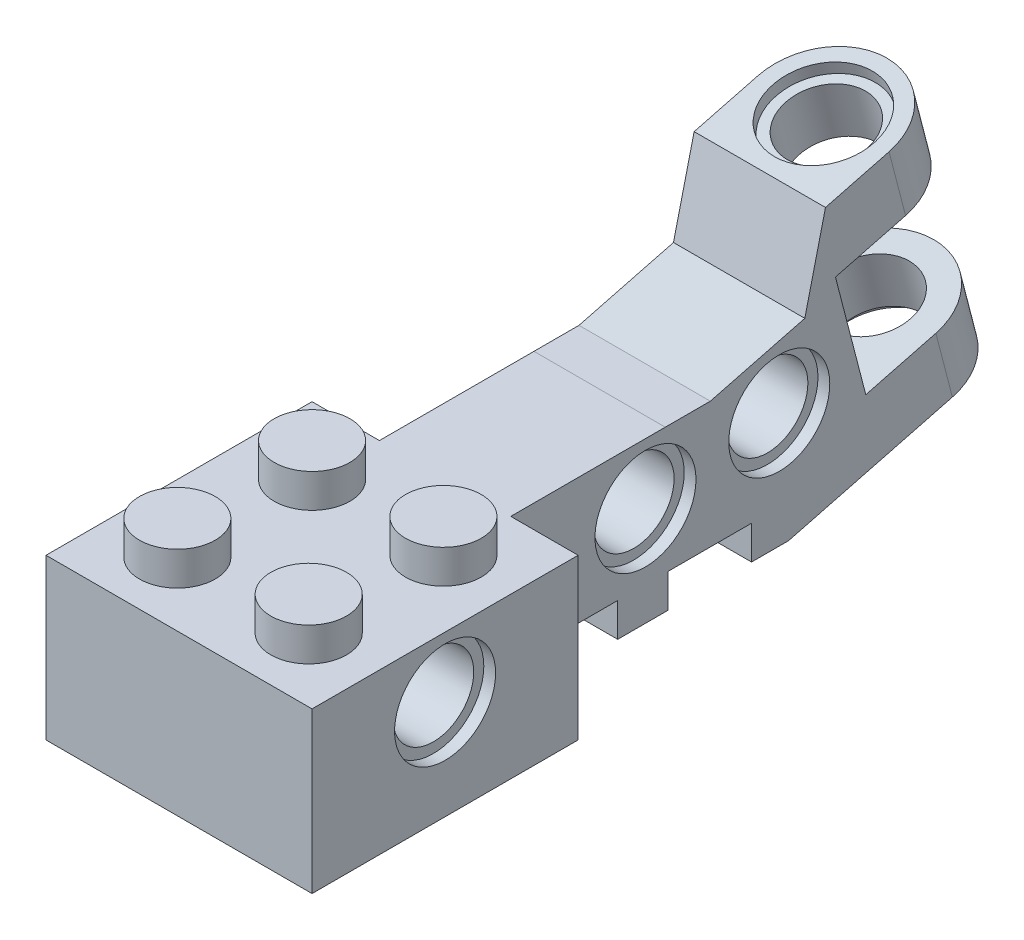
ISO-10303-21;
HEADER;
FILE_DESCRIPTION(('STEP AP214'),'2;1');
FILE_NAME('part.step','',(''),(''),'','','');
FILE_SCHEMA(('AUTOMOTIVE_DESIGN { 1 0 10303 214 1 1 1 1 }'));
ENDSEC;
DATA;
#1=APPLICATION_CONTEXT('core data for automotive mechanical design processes');
#2=APPLICATION_PROTOCOL_DEFINITION('international standard','automotive_design',2000,#1);
#3=PRODUCT_CONTEXT('',#1,'mechanical');
#4=PRODUCT('Part','Part','',(#3));
#5=PRODUCT_RELATED_PRODUCT_CATEGORY('part','',(#4));
#6=PRODUCT_DEFINITION_FORMATION('','',#4);
#7=PRODUCT_DEFINITION_CONTEXT('part definition',#1,'design');
#8=PRODUCT_DEFINITION('design','',#6,#7);
#9=PRODUCT_DEFINITION_SHAPE('','',#8);
#10=(LENGTH_UNIT() NAMED_UNIT(*) SI_UNIT(.MILLI.,.METRE.));
#11=(NAMED_UNIT(*) PLANE_ANGLE_UNIT() SI_UNIT($,.RADIAN.));
#12=(NAMED_UNIT(*) SI_UNIT($,.STERADIAN.) SOLID_ANGLE_UNIT());
#13=UNCERTAINTY_MEASURE_WITH_UNIT(LENGTH_MEASURE(1.E-05),#10,'distance_accuracy_value','');
#14=(GEOMETRIC_REPRESENTATION_CONTEXT(3) GLOBAL_UNCERTAINTY_ASSIGNED_CONTEXT((#13)) GLOBAL_UNIT_ASSIGNED_CONTEXT((#10,
#11,#12)) REPRESENTATION_CONTEXT('',''));
#15=CARTESIAN_POINT('',(0.,0.,0.));
#16=DIRECTION('',(0.,0.,1.));
#17=DIRECTION('',(1.,0.,0.));
#18=AXIS2_PLACEMENT_3D('',#15,#16,#17);
#19=CARTESIAN_POINT('',(-7.9,0.,-7.9));
#20=DIRECTION('',(0.,1.,0.));
#21=DIRECTION('',(0.,0.,1.));
#22=AXIS2_PLACEMENT_3D('',#19,#20,#21);
#23=PLANE('',#22);
#24=DIRECTION('',(0.,0.,1.));
#25=VECTOR('',#24,1.);
#26=CARTESIAN_POINT('',(-3.90000000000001,0.,-37.9));
#27=LINE('',#26,#25);
#28=CARTESIAN_POINT('',(-3.90000000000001,0.,-17.25));
#29=VERTEX_POINT('',#28);
#30=CARTESIAN_POINT('',(-3.9,0.,-14.25));
#31=VERTEX_POINT('',#30);
#32=EDGE_CURVE('E62',#29,#31,#27,.T.);
#33=ORIENTED_EDGE('',*,*,#32,.F.);
#34=DIRECTION('',(1.,0.,0.));
#35=VECTOR('',#34,1.);
#36=CARTESIAN_POINT('',(-7.9,0.,-17.25));
#37=LINE('',#36,#35);
#38=CARTESIAN_POINT('',(3.9,0.,-17.25));
#39=VERTEX_POINT('',#38);
#40=EDGE_CURVE('E46',#29,#39,#37,.T.);
#41=ORIENTED_EDGE('',*,*,#40,.T.);
#42=DIRECTION('',(0.,0.,1.));
#43=VECTOR('',#42,1.);
#44=CARTESIAN_POINT('',(3.89999999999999,0.,-37.9));
#45=LINE('',#44,#43);
#46=CARTESIAN_POINT('',(3.9,0.,-14.25));
#47=VERTEX_POINT('',#46);
#48=EDGE_CURVE('E269',#39,#47,#45,.T.);
#49=ORIENTED_EDGE('',*,*,#48,.T.);
#50=DIRECTION('',(-1.,0.,0.));
#51=VECTOR('',#50,1.);
#52=CARTESIAN_POINT('',(-7.9,0.,-14.25));
#53=LINE('',#52,#51);
#54=EDGE_CURVE('E293',#47,#31,#53,.T.);
#55=ORIENTED_EDGE('',*,*,#54,.T.);
#56=EDGE_LOOP('',(#33,#41,#49,#55));
#57=FACE_BOUND('',#56,.T.);
#58=ADVANCED_FACE('F37',(#57),#23,.F.);
#59=DIRECTION('',(1.,0.,0.));
#60=VECTOR('',#59,1.);
#61=CARTESIAN_POINT('',(6.15,0.,-6.15));
#62=LINE('',#61,#60);
#63=CARTESIAN_POINT('',(-6.15,0.,-6.15));
#64=VERTEX_POINT('',#63);
#65=CARTESIAN_POINT('',(6.15,0.,-6.15));
#66=VERTEX_POINT('',#65);
#67=EDGE_CURVE('E1274',#64,#66,#62,.T.);
#68=ORIENTED_EDGE('',*,*,#67,.F.);
#69=DIRECTION('',(0.,0.,-1.));
#70=VECTOR('',#69,1.);
#71=CARTESIAN_POINT('',(-6.15,0.,-6.15));
#72=LINE('',#71,#70);
#73=CARTESIAN_POINT('',(-6.15,0.,6.15));
#74=VERTEX_POINT('',#73);
#75=EDGE_CURVE('E1256',#74,#64,#72,.T.);
#76=ORIENTED_EDGE('',*,*,#75,.F.);
#77=DIRECTION('',(-1.,0.,0.));
#78=VECTOR('',#77,1.);
#79=CARTESIAN_POINT('',(6.15,0.,6.15));
#80=LINE('',#79,#78);
#81=CARTESIAN_POINT('',(6.15,0.,6.15));
#82=VERTEX_POINT('',#81);
#83=EDGE_CURVE('E1263',#82,#74,#80,.T.);
#84=ORIENTED_EDGE('',*,*,#83,.F.);
#85=DIRECTION('',(0.,0.,1.));
#86=VECTOR('',#85,1.);
#87=CARTESIAN_POINT('',(6.15,0.,-6.15));
#88=LINE('',#87,#86);
#89=EDGE_CURVE('E1277',#66,#82,#88,.T.);
#90=ORIENTED_EDGE('',*,*,#89,.F.);
#91=EDGE_LOOP('',(#68,#76,#84,#90));
#92=FACE_BOUND('',#91,.T.);
#93=CARTESIAN_POINT('',(-3.9,0.,-9.3));
#94=VERTEX_POINT('',#93);
#95=CARTESIAN_POINT('',(-3.9,0.,-7.9));
#96=VERTEX_POINT('',#95);
#97=EDGE_CURVE('E291',#94,#96,#27,.T.);
#98=ORIENTED_EDGE('',*,*,#97,.F.);
#99=DIRECTION('',(1.,0.,0.));
#100=VECTOR('',#99,1.);
#101=CARTESIAN_POINT('',(-7.9,0.,-9.3));
#102=LINE('',#101,#100);
#103=CARTESIAN_POINT('',(3.9,0.,-9.3));
#104=VERTEX_POINT('',#103);
#105=EDGE_CURVE('E296',#94,#104,#102,.T.);
#106=ORIENTED_EDGE('',*,*,#105,.T.);
#107=CARTESIAN_POINT('',(3.9,0.,-7.9));
#108=VERTEX_POINT('',#107);
#109=EDGE_CURVE('E274',#104,#108,#45,.T.);
#110=ORIENTED_EDGE('',*,*,#109,.T.);
#111=DIRECTION('',(-1.,0.,0.));
#112=VECTOR('',#111,1.);
#113=CARTESIAN_POINT('',(7.9,0.,-7.9));
#114=LINE('',#113,#112);
#115=CARTESIAN_POINT('',(7.9,0.,-7.9));
#116=VERTEX_POINT('',#115);
#117=EDGE_CURVE('E477',#116,#108,#114,.T.);
#118=ORIENTED_EDGE('',*,*,#117,.F.);
#119=DIRECTION('',(0.,0.,-1.));
#120=VECTOR('',#119,1.);
#121=CARTESIAN_POINT('',(7.9,0.,7.9));
#122=LINE('',#121,#120);
#123=CARTESIAN_POINT('',(7.9,0.,7.9));
#124=VERTEX_POINT('',#123);
#125=EDGE_CURVE('E478',#124,#116,#122,.T.);
#126=ORIENTED_EDGE('',*,*,#125,.F.);
#127=DIRECTION('',(1.,0.,0.));
#128=VECTOR('',#127,1.);
#129=CARTESIAN_POINT('',(7.9,0.,7.9));
#130=LINE('',#129,#128);
#131=CARTESIAN_POINT('',(-7.9,0.,7.9));
#132=VERTEX_POINT('',#131);
#133=EDGE_CURVE('E481',#132,#124,#130,.T.);
#134=ORIENTED_EDGE('',*,*,#133,.F.);
#135=DIRECTION('',(0.,0.,1.));
#136=VECTOR('',#135,1.);
#137=CARTESIAN_POINT('',(-7.9,0.,7.9));
#138=LINE('',#137,#136);
#139=CARTESIAN_POINT('',(-7.9,0.,-7.9));
#140=VERTEX_POINT('',#139);
#141=EDGE_CURVE('E476',#140,#132,#138,.T.);
#142=ORIENTED_EDGE('',*,*,#141,.F.);
#143=EDGE_CURVE('E458',#96,#140,#114,.T.);
#144=ORIENTED_EDGE('',*,*,#143,.F.);
#145=EDGE_LOOP('',(#98,#106,#110,#118,#126,#134,#142,#144));
#146=FACE_BOUND('',#145,.T.);
#147=ADVANCED_FACE('F474',(#92,#146),#23,.F.);
#148=CARTESIAN_POINT('',(3.89999999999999,0.,-37.9));
#149=DIRECTION('',(-1.,0.,0.));
#150=DIRECTION('',(0.,0.,1.));
#151=AXIS2_PLACEMENT_3D('',#148,#149,#150);
#152=PLANE('',#151);
#153=CARTESIAN_POINT('',(3.89999999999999,6.84192118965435,-23.8443555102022));
#154=DIRECTION('',(1.,0.,0.));
#155=DIRECTION('',(0.,0.,-1.));
#156=AXIS2_PLACEMENT_3D('',#153,#154,#155);
#157=CIRCLE('',#156,3.);
#158=CARTESIAN_POINT('',(3.89999999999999,6.84192118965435,-26.8443555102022));
#159=VERTEX_POINT('',#158);
#160=EDGE_CURVE('E314',#159,#159,#157,.T.);
#161=ORIENTED_EDGE('',*,*,#160,.F.);
#162=EDGE_LOOP('',(#161));
#163=FACE_BOUND('',#162,.T.);
#164=CARTESIAN_POINT('',(3.9,5.9,-15.9));
#165=DIRECTION('',(1.,0.,0.));
#166=DIRECTION('',(0.,0.,-1.));
#167=AXIS2_PLACEMENT_3D('',#164,#165,#166);
#168=CIRCLE('',#167,2.99999999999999);
#169=CARTESIAN_POINT('',(3.89999999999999,5.9,-18.9));
#170=VERTEX_POINT('',#169);
#171=EDGE_CURVE('E328',#170,#170,#168,.T.);
#172=ORIENTED_EDGE('',*,*,#171,.F.);
#173=EDGE_LOOP('',(#172));
#174=FACE_BOUND('',#173,.T.);
#175=ORIENTED_EDGE('',*,*,#48,.F.);
#176=DIRECTION('',(0.,1.,0.));
#177=VECTOR('',#176,1.);
#178=CARTESIAN_POINT('',(3.9,0.,-17.25));
#179=LINE('',#178,#177);
#180=CARTESIAN_POINT('',(3.9,2.,-17.25));
#181=VERTEX_POINT('',#180);
#182=EDGE_CURVE('E343',#39,#181,#179,.T.);
#183=ORIENTED_EDGE('',*,*,#182,.T.);
#184=DIRECTION('',(0.,0.,-1.));
#185=VECTOR('',#184,1.);
#186=CARTESIAN_POINT('',(3.89999999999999,2.,-37.9));
#187=LINE('',#186,#185);
#188=CARTESIAN_POINT('',(3.9,2.,-22.2));
#189=VERTEX_POINT('',#188);
#190=EDGE_CURVE('E261',#181,#189,#187,.T.);
#191=ORIENTED_EDGE('',*,*,#190,.T.);
#192=DIRECTION('',(0.,-1.,0.));
#193=VECTOR('',#192,1.);
#194=CARTESIAN_POINT('',(3.89999999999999,0.,-22.2));
#195=LINE('',#194,#193);
#196=CARTESIAN_POINT('',(3.9,0.,-22.2));
#197=VERTEX_POINT('',#196);
#198=EDGE_CURVE('E245',#189,#197,#195,.T.);
#199=ORIENTED_EDGE('',*,*,#198,.T.);
#200=CARTESIAN_POINT('',(3.89999999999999,0.,-24.4));
#201=VERTEX_POINT('',#200);
#202=EDGE_CURVE('E259',#201,#197,#45,.T.);
#203=ORIENTED_EDGE('',*,*,#202,.F.);
#204=DIRECTION('',(0.,0.250962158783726,-0.967996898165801));
#205=VECTOR('',#204,1.);
#206=CARTESIAN_POINT('',(3.89999999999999,3.27956298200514,-37.0497429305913));
#207=LINE('',#206,#205);
#208=CARTESIAN_POINT('',(3.89999999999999,2.52124758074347,-34.1248120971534));
#209=VERTEX_POINT('',#208);
#210=EDGE_CURVE('E446',#201,#209,#207,.T.);
#211=ORIENTED_EDGE('',*,*,#210,.T.);
#212=DIRECTION('',(0.,0.967996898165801,0.250962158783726));
#213=VECTOR('',#212,1.);
#214=CARTESIAN_POINT('',(3.89999999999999,-0.758315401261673,-34.9750691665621));
#215=LINE('',#214,#213);
#216=CARTESIAN_POINT('',(3.89999999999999,6.29643548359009,-33.1460596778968));
#217=VERTEX_POINT('',#216);
#218=EDGE_CURVE('E562',#209,#217,#215,.T.);
#219=ORIENTED_EDGE('',*,*,#218,.T.);
#220=DIRECTION('',(0.,0.250962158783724,-0.967996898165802));
#221=VECTOR('',#220,1.);
#222=CARTESIAN_POINT('',(3.89999999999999,7.05475088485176,-36.0709905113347));
#223=LINE('',#222,#221);
#224=CARTESIAN_POINT('',(3.89999999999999,5.21729820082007,-28.9836730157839));
#225=VERTEX_POINT('',#224);
#226=EDGE_CURVE('E380',#225,#217,#223,.T.);
#227=ORIENTED_EDGE('',*,*,#226,.F.);
#228=DIRECTION('',(0.,-0.967996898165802,-0.250962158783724));
#229=VECTOR('',#228,1.);
#230=CARTESIAN_POINT('',(3.89999999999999,-1.83745268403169,-30.8126825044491));
#231=LINE('',#230,#229);
#232=CARTESIAN_POINT('',(3.89999999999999,12.1669223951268,-27.1819185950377));
#233=VERTEX_POINT('',#232);
#234=EDGE_CURVE('E392',#233,#225,#231,.T.);
#235=ORIENTED_EDGE('',*,*,#234,.F.);
#236=DIRECTION('',(0.,-0.250962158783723,0.967996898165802));
#237=VECTOR('',#236,1.);
#238=CARTESIAN_POINT('',(3.89999999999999,14.0043750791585,-34.2692360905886));
#239=LINE('',#238,#237);
#240=CARTESIAN_POINT('',(3.89999999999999,13.2460596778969,-31.3443052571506));
#241=VERTEX_POINT('',#240);
#242=EDGE_CURVE('E390',#241,#233,#239,.T.);
#243=ORIENTED_EDGE('',*,*,#242,.F.);
#244=CARTESIAN_POINT('',(3.89999999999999,17.0212475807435,-30.3655528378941));
#245=VERTEX_POINT('',#244);
#246=EDGE_CURVE('E561',#241,#245,#215,.T.);
#247=ORIENTED_EDGE('',*,*,#246,.T.);
#248=DIRECTION('',(0.,0.250962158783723,-0.967996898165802));
#249=VECTOR('',#248,1.);
#250=CARTESIAN_POINT('',(3.89999999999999,17.7795629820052,-33.2904836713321));
#251=LINE('',#250,#249);
#252=CARTESIAN_POINT('',(3.89999999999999,16.042495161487,-26.5903649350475));
#253=VERTEX_POINT('',#252);
#254=EDGE_CURVE('E428',#253,#245,#251,.T.);
#255=ORIENTED_EDGE('',*,*,#254,.F.);
#256=DIRECTION('',(0.,0.972088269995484,-0.234615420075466));
#257=VECTOR('',#256,1.);
#258=CARTESIAN_POINT('',(3.89999999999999,3.46240283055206,-23.5541348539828));
#259=LINE('',#258,#257);
#260=CARTESIAN_POINT('',(3.89999999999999,10.9544999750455,-25.3623672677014));
#261=VERTEX_POINT('',#260);
#262=EDGE_CURVE('E431',#261,#253,#259,.T.);
#263=ORIENTED_EDGE('',*,*,#262,.F.);
#264=DIRECTION('',(0.,0.250962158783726,-0.967996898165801));
#265=VECTOR('',#264,1.);
#266=CARTESIAN_POINT('',(3.89999999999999,13.3103381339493,-34.449171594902));
#267=LINE('',#266,#265);
#268=CARTESIAN_POINT('',(3.89999999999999,9.49999999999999,-19.7521530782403));
#269=VERTEX_POINT('',#268);
#270=EDGE_CURVE('E434',#269,#261,#267,.T.);
#271=ORIENTED_EDGE('',*,*,#270,.F.);
#272=DIRECTION('',(0.,0.,-1.));
#273=VECTOR('',#272,1.);
#274=CARTESIAN_POINT('',(3.89999999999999,9.5,-37.9));
#275=LINE('',#274,#273);
#276=CARTESIAN_POINT('',(3.9,9.5,-17.0765622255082));
#277=VERTEX_POINT('',#276);
#278=EDGE_CURVE('E437',#277,#269,#275,.T.);
#279=ORIENTED_EDGE('',*,*,#278,.F.);
#280=DIRECTION('',(0.,0.,-1.));
#281=VECTOR('',#280,1.);
#282=CARTESIAN_POINT('',(3.89999999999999,9.5,-37.9));
#283=LINE('',#282,#281);
#284=CARTESIAN_POINT('',(3.9,9.5,-7.9));
#285=VERTEX_POINT('',#284);
#286=EDGE_CURVE('E440',#285,#277,#283,.T.);
#287=ORIENTED_EDGE('',*,*,#286,.F.);
#288=DIRECTION('',(0.,-1.,0.));
#289=VECTOR('',#288,1.);
#290=CARTESIAN_POINT('',(3.9,0.,-7.9));
#291=LINE('',#290,#289);
#292=EDGE_CURVE('E454',#285,#108,#291,.T.);
#293=ORIENTED_EDGE('',*,*,#292,.T.);
#294=ORIENTED_EDGE('',*,*,#109,.F.);
#295=DIRECTION('',(0.,1.,0.));
#296=VECTOR('',#295,1.);
#297=CARTESIAN_POINT('',(3.9,0.,-9.3));
#298=LINE('',#297,#296);
#299=CARTESIAN_POINT('',(3.9,2.,-9.3));
#300=VERTEX_POINT('',#299);
#301=EDGE_CURVE('E360',#104,#300,#298,.T.);
#302=ORIENTED_EDGE('',*,*,#301,.T.);
#303=DIRECTION('',(0.,0.,-1.));
#304=VECTOR('',#303,1.);
#305=CARTESIAN_POINT('',(3.89999999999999,2.,-37.9));
#306=LINE('',#305,#304);
#307=CARTESIAN_POINT('',(3.9,2.,-14.25));
#308=VERTEX_POINT('',#307);
#309=EDGE_CURVE('E363',#300,#308,#306,.T.);
#310=ORIENTED_EDGE('',*,*,#309,.T.);
#311=DIRECTION('',(0.,-1.,0.));
#312=VECTOR('',#311,1.);
#313=CARTESIAN_POINT('',(3.9,0.,-14.25));
#314=LINE('',#313,#312);
#315=EDGE_CURVE('E354',#308,#47,#314,.T.);
#316=ORIENTED_EDGE('',*,*,#315,.T.);
#317=EDGE_LOOP('',(#175,#183,#191,#199,#203,#211,#219,#227,#235,#243,#247,#255,#263,#271,#279,
#287,#293,#294,#302,#310,#316));
#318=FACE_BOUND('',#317,.T.);
#319=ADVANCED_FACE('F257',(#163,#174,#318),#152,.F.);
#320=CARTESIAN_POINT('',(-3.90000000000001,0.,-37.9));
#321=DIRECTION('',(1.,0.,0.));
#322=DIRECTION('',(0.,0.,-1.));
#323=AXIS2_PLACEMENT_3D('',#320,#321,#322);
#324=PLANE('',#323);
#325=CARTESIAN_POINT('',(-3.90000000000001,6.84192118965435,-23.8443555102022));
#326=DIRECTION('',(-1.,0.,0.));
#327=DIRECTION('',(0.,0.,1.));
#328=AXIS2_PLACEMENT_3D('',#325,#326,#327);
#329=CIRCLE('',#328,3.);
#330=CARTESIAN_POINT('',(-3.90000000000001,6.84192118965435,-20.8443555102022));
#331=VERTEX_POINT('',#330);
#332=EDGE_CURVE('E322',#331,#331,#329,.T.);
#333=ORIENTED_EDGE('',*,*,#332,.F.);
#334=EDGE_LOOP('',(#333));
#335=FACE_BOUND('',#334,.T.);
#336=CARTESIAN_POINT('',(-3.9,5.9,-15.9));
#337=DIRECTION('',(-1.,0.,0.));
#338=DIRECTION('',(0.,0.,1.));
#339=AXIS2_PLACEMENT_3D('',#336,#337,#338);
#340=CIRCLE('',#339,3.);
#341=CARTESIAN_POINT('',(-3.9,5.9,-12.9));
#342=VERTEX_POINT('',#341);
#343=EDGE_CURVE('E311',#342,#342,#340,.T.);
#344=ORIENTED_EDGE('',*,*,#343,.F.);
#345=EDGE_LOOP('',(#344));
#346=FACE_BOUND('',#345,.T.);
#347=DIRECTION('',(0.,0.,1.));
#348=VECTOR('',#347,1.);
#349=CARTESIAN_POINT('',(-3.90000000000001,2.,-37.9));
#350=LINE('',#349,#348);
#351=CARTESIAN_POINT('',(-3.9,2.,-22.2));
#352=VERTEX_POINT('',#351);
#353=CARTESIAN_POINT('',(-3.9,2.,-17.25));
#354=VERTEX_POINT('',#353);
#355=EDGE_CURVE('E11',#352,#354,#350,.T.);
#356=ORIENTED_EDGE('',*,*,#355,.T.);
#357=DIRECTION('',(0.,-1.,0.));
#358=VECTOR('',#357,1.);
#359=CARTESIAN_POINT('',(-3.9,0.,-17.25));
#360=LINE('',#359,#358);
#361=EDGE_CURVE('E262',#354,#29,#360,.T.);
#362=ORIENTED_EDGE('',*,*,#361,.T.);
#363=ORIENTED_EDGE('',*,*,#32,.T.);
#364=DIRECTION('',(0.,1.,0.));
#365=VECTOR('',#364,1.);
#366=CARTESIAN_POINT('',(-3.9,0.,-14.25));
#367=LINE('',#366,#365);
#368=CARTESIAN_POINT('',(-3.9,2.,-14.25));
#369=VERTEX_POINT('',#368);
#370=EDGE_CURVE('E352',#31,#369,#367,.T.);
#371=ORIENTED_EDGE('',*,*,#370,.T.);
#372=DIRECTION('',(0.,0.,1.));
#373=VECTOR('',#372,1.);
#374=CARTESIAN_POINT('',(-3.90000000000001,2.,-37.9));
#375=LINE('',#374,#373);
#376=CARTESIAN_POINT('',(-3.9,2.,-9.3));
#377=VERTEX_POINT('',#376);
#378=EDGE_CURVE('E251',#369,#377,#375,.T.);
#379=ORIENTED_EDGE('',*,*,#378,.T.);
#380=DIRECTION('',(0.,-1.,0.));
#381=VECTOR('',#380,1.);
#382=CARTESIAN_POINT('',(-3.9,0.,-9.3));
#383=LINE('',#382,#381);
#384=EDGE_CURVE('E357',#377,#94,#383,.T.);
#385=ORIENTED_EDGE('',*,*,#384,.T.);
#386=ORIENTED_EDGE('',*,*,#97,.T.);
#387=DIRECTION('',(0.,1.,0.));
#388=VECTOR('',#387,1.);
#389=CARTESIAN_POINT('',(-3.9,0.,-7.9));
#390=LINE('',#389,#388);
#391=CARTESIAN_POINT('',(-3.9,9.5,-7.9));
#392=VERTEX_POINT('',#391);
#393=EDGE_CURVE('E448',#96,#392,#390,.T.);
#394=ORIENTED_EDGE('',*,*,#393,.T.);
#395=DIRECTION('',(0.,0.,1.));
#396=VECTOR('',#395,1.);
#397=CARTESIAN_POINT('',(-3.90000000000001,9.5,-37.9));
#398=LINE('',#397,#396);
#399=CARTESIAN_POINT('',(-3.9,9.5,-17.0765622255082));
#400=VERTEX_POINT('',#399);
#401=EDGE_CURVE('E543',#400,#392,#398,.T.);
#402=ORIENTED_EDGE('',*,*,#401,.F.);
#403=DIRECTION('',(0.,0.,1.));
#404=VECTOR('',#403,1.);
#405=CARTESIAN_POINT('',(-3.90000000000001,9.5,-37.9));
#406=LINE('',#405,#404);
#407=CARTESIAN_POINT('',(-3.90000000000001,9.49999999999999,-19.7521530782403));
#408=VERTEX_POINT('',#407);
#409=EDGE_CURVE('E541',#408,#400,#406,.T.);
#410=ORIENTED_EDGE('',*,*,#409,.F.);
#411=DIRECTION('',(0.,-0.250962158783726,0.967996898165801));
#412=VECTOR('',#411,1.);
#413=CARTESIAN_POINT('',(-3.90000000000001,13.3103381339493,-34.449171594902));
#414=LINE('',#413,#412);
#415=CARTESIAN_POINT('',(-3.90000000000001,10.9544999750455,-25.3623672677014));
#416=VERTEX_POINT('',#415);
#417=EDGE_CURVE('E544',#416,#408,#414,.T.);
#418=ORIENTED_EDGE('',*,*,#417,.F.);
#419=DIRECTION('',(0.,-0.972088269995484,0.234615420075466));
#420=VECTOR('',#419,1.);
#421=CARTESIAN_POINT('',(-3.90000000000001,3.46240283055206,-23.5541348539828));
#422=LINE('',#421,#420);
#423=CARTESIAN_POINT('',(-3.90000000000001,16.042495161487,-26.5903649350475));
#424=VERTEX_POINT('',#423);
#425=EDGE_CURVE('E281',#424,#416,#422,.T.);
#426=ORIENTED_EDGE('',*,*,#425,.F.);
#427=DIRECTION('',(0.,-0.250962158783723,0.967996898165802));
#428=VECTOR('',#427,1.);
#429=CARTESIAN_POINT('',(-3.90000000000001,17.7795629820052,-33.2904836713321));
#430=LINE('',#429,#428);
#431=CARTESIAN_POINT('',(-3.90000000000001,17.0212475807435,-30.3655528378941));
#432=VERTEX_POINT('',#431);
#433=EDGE_CURVE('E426',#432,#424,#430,.T.);
#434=ORIENTED_EDGE('',*,*,#433,.F.);
#435=DIRECTION('',(0.,-0.967996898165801,-0.250962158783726));
#436=VECTOR('',#435,1.);
#437=CARTESIAN_POINT('',(-3.90000000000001,-0.758315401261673,-34.9750691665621));
#438=LINE('',#437,#436);
#439=CARTESIAN_POINT('',(-3.90000000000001,13.2460596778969,-31.3443052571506));
#440=VERTEX_POINT('',#439);
#441=EDGE_CURVE('E549',#432,#440,#438,.T.);
#442=ORIENTED_EDGE('',*,*,#441,.T.);
#443=DIRECTION('',(0.,0.250962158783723,-0.967996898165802));
#444=VECTOR('',#443,1.);
#445=CARTESIAN_POINT('',(-3.90000000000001,14.0043750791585,-34.2692360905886));
#446=LINE('',#445,#444);
#447=CARTESIAN_POINT('',(-3.9,12.1669223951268,-27.1819185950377));
#448=VERTEX_POINT('',#447);
#449=EDGE_CURVE('E388',#448,#440,#446,.T.);
#450=ORIENTED_EDGE('',*,*,#449,.F.);
#451=DIRECTION('',(0.,0.967996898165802,0.250962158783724));
#452=VECTOR('',#451,1.);
#453=CARTESIAN_POINT('',(-3.90000000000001,-1.83745268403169,-30.8126825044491));
#454=LINE('',#453,#452);
#455=CARTESIAN_POINT('',(-3.9,5.21729820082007,-28.9836730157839));
#456=VERTEX_POINT('',#455);
#457=EDGE_CURVE('E297',#456,#448,#454,.T.);
#458=ORIENTED_EDGE('',*,*,#457,.F.);
#459=DIRECTION('',(0.,-0.250962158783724,0.967996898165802));
#460=VECTOR('',#459,1.);
#461=CARTESIAN_POINT('',(-3.90000000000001,7.05475088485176,-36.0709905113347));
#462=LINE('',#461,#460);
#463=CARTESIAN_POINT('',(-3.90000000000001,6.29643548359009,-33.1460596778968));
#464=VERTEX_POINT('',#463);
#465=EDGE_CURVE('E378',#464,#456,#462,.T.);
#466=ORIENTED_EDGE('',*,*,#465,.F.);
#467=CARTESIAN_POINT('',(-3.90000000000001,2.52124758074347,-34.1248120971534));
#468=VERTEX_POINT('',#467);
#469=EDGE_CURVE('E546',#464,#468,#438,.T.);
#470=ORIENTED_EDGE('',*,*,#469,.T.);
#471=DIRECTION('',(0.,-0.250962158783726,0.967996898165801));
#472=VECTOR('',#471,1.);
#473=CARTESIAN_POINT('',(-3.90000000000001,3.27956298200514,-37.0497429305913));
#474=LINE('',#473,#472);
#475=CARTESIAN_POINT('',(-3.90000000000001,0.,-24.4));
#476=VERTEX_POINT('',#475);
#477=EDGE_CURVE('E444',#468,#476,#474,.T.);
#478=ORIENTED_EDGE('',*,*,#477,.T.);
#479=CARTESIAN_POINT('',(-3.90000000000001,0.,-22.2));
#480=VERTEX_POINT('',#479);
#481=EDGE_CURVE('E279',#476,#480,#27,.T.);
#482=ORIENTED_EDGE('',*,*,#481,.T.);
#483=DIRECTION('',(0.,1.,0.));
#484=VECTOR('',#483,1.);
#485=CARTESIAN_POINT('',(-3.90000000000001,0.,-22.2));
#486=LINE('',#485,#484);
#487=EDGE_CURVE('E54',#480,#352,#486,.T.);
#488=ORIENTED_EDGE('',*,*,#487,.T.);
#489=EDGE_LOOP('',(#356,#362,#363,#371,#379,#385,#386,#394,#402,#410,#418,#426,#434,#442,#450,
#458,#466,#470,#478,#482,#488));
#490=FACE_BOUND('',#489,.T.);
#491=ADVANCED_FACE('F465',(#335,#346,#490),#324,.F.);
#492=CARTESIAN_POINT('',(0.,-0.758315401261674,-34.9750691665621));
#493=DIRECTION('',(0.,0.967996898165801,0.250962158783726));
#494=DIRECTION('',(0.,-0.250962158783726,0.967996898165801));
#495=AXIS2_PLACEMENT_3D('',#492,#493,#494);
#496=CYLINDRICAL_SURFACE('',#495,3.9);
#497=ORIENTED_EDGE('',*,*,#246,.F.);
#498=CARTESIAN_POINT('',(0.,13.2460596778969,-31.3443052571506));
#499=DIRECTION('',(0.,-0.967996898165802,-0.250962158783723));
#500=DIRECTION('',(0.,0.250962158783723,-0.967996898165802));
#501=AXIS2_PLACEMENT_3D('',#498,#499,#500);
#502=CIRCLE('',#501,3.9);
#503=CARTESIAN_POINT('',(0.,14.2248120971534,-35.1194931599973));
#504=VERTEX_POINT('',#503);
#505=EDGE_CURVE('E385',#241,#504,#502,.F.);
#506=ORIENTED_EDGE('',*,*,#505,.T.);
#507=DIRECTION('',(0.,0.967996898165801,0.250962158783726));
#508=VECTOR('',#507,1.);
#509=CARTESIAN_POINT('',(0.,3.5,-37.9));
#510=LINE('',#509,#508);
#511=CARTESIAN_POINT('',(0.,18.,-34.1407407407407));
#512=VERTEX_POINT('',#511);
#513=EDGE_CURVE('E417',#512,#504,#510,.F.);
#514=ORIENTED_EDGE('',*,*,#513,.F.);
#515=CARTESIAN_POINT('',(0.,17.0212475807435,-30.3655528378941));
#516=DIRECTION('',(0.,0.967996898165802,0.250962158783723));
#517=DIRECTION('',(0.,-0.250962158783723,0.967996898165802));
#518=AXIS2_PLACEMENT_3D('',#515,#516,#517);
#519=CIRCLE('',#518,3.9);
#520=EDGE_CURVE('E557',#245,#512,#519,.T.);
#521=ORIENTED_EDGE('',*,*,#520,.F.);
#522=EDGE_LOOP('',(#497,#506,#514,#521));
#523=FACE_BOUND('',#522,.T.);
#524=ADVANCED_FACE('F39',(#523),#496,.T.);
#525=CARTESIAN_POINT('',(0.,7.27518790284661,-36.9212475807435));
#526=VERTEX_POINT('',#525);
#527=CARTESIAN_POINT('',(0.,3.5,-37.9));
#528=VERTEX_POINT('',#527);
#529=EDGE_CURVE('E410',#526,#528,#510,.F.);
#530=ORIENTED_EDGE('',*,*,#529,.F.);
#531=CARTESIAN_POINT('',(0.,6.29643548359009,-33.1460596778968));
#532=DIRECTION('',(0.,0.967996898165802,0.250962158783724));
#533=DIRECTION('',(0.,-0.250962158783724,0.967996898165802));
#534=AXIS2_PLACEMENT_3D('',#531,#532,#533);
#535=CIRCLE('',#534,3.9);
#536=EDGE_CURVE('E375',#526,#217,#535,.F.);
#537=ORIENTED_EDGE('',*,*,#536,.T.);
#538=ORIENTED_EDGE('',*,*,#218,.F.);
#539=CARTESIAN_POINT('',(0.,2.52124758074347,-34.1248120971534));
#540=DIRECTION('',(0.,0.967996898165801,0.250962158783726));
#541=DIRECTION('',(0.,-0.250962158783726,0.967996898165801));
#542=AXIS2_PLACEMENT_3D('',#539,#540,#541);
#543=CIRCLE('',#542,3.9);
#544=EDGE_CURVE('E552',#528,#209,#543,.F.);
#545=ORIENTED_EDGE('',*,*,#544,.F.);
#546=EDGE_LOOP('',(#530,#537,#538,#545));
#547=FACE_BOUND('',#546,.T.);
#548=ADVANCED_FACE('F644',(#547),#496,.T.);
#549=CARTESIAN_POINT('',(0.,-0.758315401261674,-34.9750691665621));
#550=DIRECTION('',(0.,-0.967996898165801,-0.250962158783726));
#551=DIRECTION('',(0.,0.250962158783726,-0.967996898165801));
#552=AXIS2_PLACEMENT_3D('',#549,#550,#551);
#553=CYLINDRICAL_SURFACE('',#552,3.9);
#554=ORIENTED_EDGE('',*,*,#513,.T.);
#555=CARTESIAN_POINT('',(0.,13.2460596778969,-31.3443052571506));
#556=DIRECTION('',(0.,-0.967996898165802,-0.250962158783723));
#557=DIRECTION('',(0.,0.250962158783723,-0.967996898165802));
#558=AXIS2_PLACEMENT_3D('',#555,#556,#557);
#559=CIRCLE('',#558,3.9);
#560=EDGE_CURVE('E382',#504,#440,#559,.F.);
#561=ORIENTED_EDGE('',*,*,#560,.T.);
#562=ORIENTED_EDGE('',*,*,#441,.F.);
#563=CARTESIAN_POINT('',(0.,17.0212475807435,-30.3655528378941));
#564=DIRECTION('',(0.,0.967996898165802,0.250962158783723));
#565=DIRECTION('',(0.,-0.250962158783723,0.967996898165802));
#566=AXIS2_PLACEMENT_3D('',#563,#564,#565);
#567=CIRCLE('',#566,3.9);
#568=EDGE_CURVE('E559',#512,#432,#567,.T.);
#569=ORIENTED_EDGE('',*,*,#568,.F.);
#570=EDGE_LOOP('',(#554,#561,#562,#569));
#571=FACE_BOUND('',#570,.T.);
#572=ADVANCED_FACE('F588',(#571),#553,.T.);
#573=ORIENTED_EDGE('',*,*,#469,.F.);
#574=CARTESIAN_POINT('',(0.,6.29643548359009,-33.1460596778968));
#575=DIRECTION('',(0.,0.967996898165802,0.250962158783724));
#576=DIRECTION('',(0.,-0.250962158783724,0.967996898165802));
#577=AXIS2_PLACEMENT_3D('',#574,#575,#576);
#578=CIRCLE('',#577,3.9);
#579=EDGE_CURVE('E372',#464,#526,#578,.F.);
#580=ORIENTED_EDGE('',*,*,#579,.T.);
#581=ORIENTED_EDGE('',*,*,#529,.T.);
#582=CARTESIAN_POINT('',(0.,2.52124758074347,-34.1248120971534));
#583=DIRECTION('',(0.,0.967996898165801,0.250962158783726));
#584=DIRECTION('',(0.,-0.250962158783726,0.967996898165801));
#585=AXIS2_PLACEMENT_3D('',#582,#583,#584);
#586=CIRCLE('',#585,3.9);
#587=EDGE_CURVE('E554',#468,#528,#586,.F.);
#588=ORIENTED_EDGE('',*,*,#587,.F.);
#589=EDGE_LOOP('',(#573,#580,#581,#588));
#590=FACE_BOUND('',#589,.T.);
#591=ADVANCED_FACE('F643',(#590),#553,.T.);
#592=CARTESIAN_POINT('',(0.,27.2342295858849,-27.717742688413));
#593=DIRECTION('',(0.,-0.967996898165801,-0.250962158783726));
#594=DIRECTION('',(0.,0.250962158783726,-0.967996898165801));
#595=AXIS2_PLACEMENT_3D('',#592,#593,#594);
#596=CYLINDRICAL_SURFACE('',#595,2.4);
#597=CARTESIAN_POINT('',(0.,16.3436497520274,-30.5412263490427));
#598=DIRECTION('',(0.,0.967996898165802,0.250962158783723));
#599=DIRECTION('',(0.,-0.250962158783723,0.967996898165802));
#600=AXIS2_PLACEMENT_3D('',#597,#598,#599);
#601=CIRCLE('',#600,2.4);
#602=CARTESIAN_POINT('',(0.,15.7413405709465,-28.2180337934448));
#603=VERTEX_POINT('',#602);
#604=EDGE_CURVE('E397',#603,#603,#601,.T.);
#605=ORIENTED_EDGE('',*,*,#604,.T.);
#606=EDGE_LOOP('',(#605));
#607=FACE_BOUND('',#606,.T.);
#608=CARTESIAN_POINT('',(0.,13.2460596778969,-31.3443052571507));
#609=DIRECTION('',(0.,-0.967996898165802,-0.250962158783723));
#610=DIRECTION('',(0.,0.250962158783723,-0.967996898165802));
#611=AXIS2_PLACEMENT_3D('',#608,#609,#610);
#612=CIRCLE('',#611,2.4);
#613=CARTESIAN_POINT('',(0.,13.8483688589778,-33.6674978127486));
#614=VERTEX_POINT('',#613);
#615=EDGE_CURVE('E570',#614,#614,#612,.F.);
#616=ORIENTED_EDGE('',*,*,#615,.F.);
#617=EDGE_LOOP('',(#616));
#618=FACE_BOUND('',#617,.T.);
#619=ADVANCED_FACE('F649',(#607,#618),#596,.F.);
#620=CARTESIAN_POINT('',(0.,3.19884540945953,-33.9491385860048));
#621=DIRECTION('',(0.,-0.967996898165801,-0.250962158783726));
#622=DIRECTION('',(0.,0.250962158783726,-0.967996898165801));
#623=AXIS2_PLACEMENT_3D('',#620,#621,#622);
#624=CIRCLE('',#623,2.4);
#625=CARTESIAN_POINT('',(0.,3.80115459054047,-36.2723311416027));
#626=VERTEX_POINT('',#625);
#627=EDGE_CURVE('E394',#626,#626,#624,.T.);
#628=ORIENTED_EDGE('',*,*,#627,.T.);
#629=EDGE_LOOP('',(#628));
#630=FACE_BOUND('',#629,.T.);
#631=CARTESIAN_POINT('',(0.,6.29643548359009,-33.1460596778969));
#632=DIRECTION('',(0.,0.967996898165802,0.250962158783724));
#633=DIRECTION('',(0.,-0.250962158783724,0.967996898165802));
#634=AXIS2_PLACEMENT_3D('',#631,#632,#633);
#635=CIRCLE('',#634,2.4);
#636=CARTESIAN_POINT('',(0.,5.69412630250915,-30.8228671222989));
#637=VERTEX_POINT('',#636);
#638=EDGE_CURVE('E565',#637,#637,#635,.F.);
#639=ORIENTED_EDGE('',*,*,#638,.F.);
#640=EDGE_LOOP('',(#639));
#641=FACE_BOUND('',#640,.T.);
#642=ADVANCED_FACE('F685',(#630,#641),#596,.F.);
#643=CARTESIAN_POINT('',(7.9,9.5,-7.9));
#644=DIRECTION('',(0.,0.,1.));
#645=DIRECTION('',(1.,0.,0.));
#646=AXIS2_PLACEMENT_3D('',#643,#644,#645);
#647=PLANE('',#646);
#648=ORIENTED_EDGE('',*,*,#292,.F.);
#649=DIRECTION('',(-1.,0.,0.));
#650=VECTOR('',#649,1.);
#651=CARTESIAN_POINT('',(7.9,9.5,-7.9));
#652=LINE('',#651,#650);
#653=CARTESIAN_POINT('',(7.9,9.5,-7.9));
#654=VERTEX_POINT('',#653);
#655=EDGE_CURVE('E503',#654,#285,#652,.T.);
#656=ORIENTED_EDGE('',*,*,#655,.F.);
#657=DIRECTION('',(0.,-1.,0.));
#658=VECTOR('',#657,1.);
#659=CARTESIAN_POINT('',(7.9,9.5,-7.9));
#660=LINE('',#659,#658);
#661=EDGE_CURVE('E499',#654,#116,#660,.T.);
#662=ORIENTED_EDGE('',*,*,#661,.T.);
#663=ORIENTED_EDGE('',*,*,#117,.T.);
#664=EDGE_LOOP('',(#648,#656,#662,#663));
#665=FACE_BOUND('',#664,.T.);
#666=ADVANCED_FACE('F534',(#665),#647,.F.);
#667=ORIENTED_EDGE('',*,*,#393,.F.);
#668=ORIENTED_EDGE('',*,*,#143,.T.);
#669=DIRECTION('',(0.,-1.,0.));
#670=VECTOR('',#669,1.);
#671=CARTESIAN_POINT('',(-7.9,9.5,-7.9));
#672=LINE('',#671,#670);
#673=CARTESIAN_POINT('',(-7.9,9.5,-7.9));
#674=VERTEX_POINT('',#673);
#675=EDGE_CURVE('E492',#674,#140,#672,.T.);
#676=ORIENTED_EDGE('',*,*,#675,.F.);
#677=EDGE_CURVE('E472',#392,#674,#652,.T.);
#678=ORIENTED_EDGE('',*,*,#677,.F.);
#679=EDGE_LOOP('',(#667,#668,#676,#678));
#680=FACE_BOUND('',#679,.T.);
#681=ADVANCED_FACE('F469',(#680),#647,.F.);
#682=CARTESIAN_POINT('',(-7.9,9.5,-7.9));
#683=DIRECTION('',(0.,1.,0.));
#684=DIRECTION('',(0.,0.,1.));
#685=AXIS2_PLACEMENT_3D('',#682,#683,#684);
#686=PLANE('',#685);
#687=CARTESIAN_POINT('',(-3.9,9.5,4.1));
#688=DIRECTION('',(0.,1.,0.));
#689=DIRECTION('',(0.,0.,1.));
#690=AXIS2_PLACEMENT_3D('',#687,#688,#689);
#691=CIRCLE('',#690,2.25);
#692=CARTESIAN_POINT('',(-3.9,9.5,6.35));
#693=VERTEX_POINT('',#692);
#694=EDGE_CURVE('E1250',#693,#693,#691,.T.);
#695=ORIENTED_EDGE('',*,*,#694,.F.);
#696=EDGE_LOOP('',(#695));
#697=FACE_BOUND('',#696,.T.);
#698=CARTESIAN_POINT('',(-3.9,9.5,-3.9));
#699=DIRECTION('',(0.,1.,0.));
#700=DIRECTION('',(0.,0.,1.));
#701=AXIS2_PLACEMENT_3D('',#698,#699,#700);
#702=CIRCLE('',#701,2.25);
#703=CARTESIAN_POINT('',(-3.9,9.5,-1.65));
#704=VERTEX_POINT('',#703);
#705=EDGE_CURVE('E515',#704,#704,#702,.T.);
#706=ORIENTED_EDGE('',*,*,#705,.F.);
#707=EDGE_LOOP('',(#706));
#708=FACE_BOUND('',#707,.T.);
#709=DIRECTION('',(0.,0.,1.));
#710=VECTOR('',#709,1.);
#711=CARTESIAN_POINT('',(-7.9,9.5,7.9));
#712=LINE('',#711,#710);
#713=CARTESIAN_POINT('',(-7.9,9.5,7.9));
#714=VERTEX_POINT('',#713);
#715=EDGE_CURVE('E480',#674,#714,#712,.T.);
#716=ORIENTED_EDGE('',*,*,#715,.T.);
#717=DIRECTION('',(1.,0.,0.));
#718=VECTOR('',#717,1.);
#719=CARTESIAN_POINT('',(7.9,9.5,7.9));
#720=LINE('',#719,#718);
#721=CARTESIAN_POINT('',(7.9,9.5,7.9));
#722=VERTEX_POINT('',#721);
#723=EDGE_CURVE('E527',#714,#722,#720,.T.);
#724=ORIENTED_EDGE('',*,*,#723,.T.);
#725=DIRECTION('',(0.,0.,-1.));
#726=VECTOR('',#725,1.);
#727=CARTESIAN_POINT('',(7.9,9.5,7.9));
#728=LINE('',#727,#726);
#729=EDGE_CURVE('E509',#722,#654,#728,.T.);
#730=ORIENTED_EDGE('',*,*,#729,.T.);
#731=ORIENTED_EDGE('',*,*,#655,.T.);
#732=ORIENTED_EDGE('',*,*,#286,.T.);
#733=DIRECTION('',(-1.,0.,0.));
#734=VECTOR('',#733,1.);
#735=CARTESIAN_POINT('',(68.5055746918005,9.5,-17.0765622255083));
#736=LINE('',#735,#734);
#737=EDGE_CURVE('E423',#277,#400,#736,.T.);
#738=ORIENTED_EDGE('',*,*,#737,.T.);
#739=ORIENTED_EDGE('',*,*,#401,.T.);
#740=ORIENTED_EDGE('',*,*,#677,.T.);
#741=EDGE_LOOP('',(#716,#724,#730,#731,#732,#738,#739,#740));
#742=FACE_BOUND('',#741,.T.);
#743=CARTESIAN_POINT('',(3.9,9.5,-3.9));
#744=DIRECTION('',(0.,1.,0.));
#745=DIRECTION('',(0.,0.,1.));
#746=AXIS2_PLACEMENT_3D('',#743,#744,#745);
#747=CIRCLE('',#746,2.25);
#748=CARTESIAN_POINT('',(3.9,9.5,-1.65));
#749=VERTEX_POINT('',#748);
#750=EDGE_CURVE('E523',#749,#749,#747,.T.);
#751=ORIENTED_EDGE('',*,*,#750,.F.);
#752=EDGE_LOOP('',(#751));
#753=FACE_BOUND('',#752,.T.);
#754=CARTESIAN_POINT('',(3.9,9.5,4.1));
#755=DIRECTION('',(0.,1.,0.));
#756=DIRECTION('',(0.,0.,1.));
#757=AXIS2_PLACEMENT_3D('',#754,#755,#756);
#758=CIRCLE('',#757,2.25);
#759=CARTESIAN_POINT('',(3.9,9.5,6.35));
#760=VERTEX_POINT('',#759);
#761=EDGE_CURVE('E1245',#760,#760,#758,.T.);
#762=ORIENTED_EDGE('',*,*,#761,.F.);
#763=EDGE_LOOP('',(#762));
#764=FACE_BOUND('',#763,.T.);
#765=ADVANCED_FACE('F530',(#697,#708,#742,#753,#764),#686,.T.);
#766=CARTESIAN_POINT('',(-7.9,9.5,7.9));
#767=DIRECTION('',(1.,0.,0.));
#768=DIRECTION('',(0.,0.,-1.));
#769=AXIS2_PLACEMENT_3D('',#766,#767,#768);
#770=PLANE('',#769);
#771=CARTESIAN_POINT('',(-7.9,5.9,0.));
#772=DIRECTION('',(-1.,0.,0.));
#773=DIRECTION('',(0.,0.,1.));
#774=AXIS2_PLACEMENT_3D('',#771,#772,#773);
#775=CIRCLE('',#774,3.);
#776=CARTESIAN_POINT('',(-7.9,5.9,3.));
#777=VERTEX_POINT('',#776);
#778=EDGE_CURVE('E1236',#777,#777,#775,.T.);
#779=ORIENTED_EDGE('',*,*,#778,.F.);
#780=EDGE_LOOP('',(#779));
#781=FACE_BOUND('',#780,.T.);
#782=ORIENTED_EDGE('',*,*,#141,.T.);
#783=DIRECTION('',(0.,-1.,0.));
#784=VECTOR('',#783,1.);
#785=CARTESIAN_POINT('',(-7.9,9.5,7.9));
#786=LINE('',#785,#784);
#787=EDGE_CURVE('E457',#714,#132,#786,.T.);
#788=ORIENTED_EDGE('',*,*,#787,.F.);
#789=ORIENTED_EDGE('',*,*,#715,.F.);
#790=ORIENTED_EDGE('',*,*,#675,.T.);
#791=EDGE_LOOP('',(#782,#788,#789,#790));
#792=FACE_BOUND('',#791,.T.);
#793=ADVANCED_FACE('F635',(#781,#792),#770,.F.);
#794=CARTESIAN_POINT('',(7.9,9.5,7.9));
#795=DIRECTION('',(0.,0.,-1.));
#796=DIRECTION('',(-1.,0.,0.));
#797=AXIS2_PLACEMENT_3D('',#794,#795,#796);
#798=PLANE('',#797);
#799=ORIENTED_EDGE('',*,*,#133,.T.);
#800=DIRECTION('',(0.,-1.,0.));
#801=VECTOR('',#800,1.);
#802=CARTESIAN_POINT('',(7.9,9.5,7.9));
#803=LINE('',#802,#801);
#804=EDGE_CURVE('E498',#722,#124,#803,.T.);
#805=ORIENTED_EDGE('',*,*,#804,.F.);
#806=ORIENTED_EDGE('',*,*,#723,.F.);
#807=ORIENTED_EDGE('',*,*,#787,.T.);
#808=EDGE_LOOP('',(#799,#805,#806,#807));
#809=FACE_BOUND('',#808,.T.);
#810=ADVANCED_FACE('F629',(#809),#798,.F.);
#811=CARTESIAN_POINT('',(7.9,9.5,7.9));
#812=DIRECTION('',(-1.,0.,0.));
#813=DIRECTION('',(0.,0.,1.));
#814=AXIS2_PLACEMENT_3D('',#811,#812,#813);
#815=PLANE('',#814);
#816=CARTESIAN_POINT('',(7.9,5.9,0.));
#817=DIRECTION('',(1.,0.,0.));
#818=DIRECTION('',(0.,0.,-1.));
#819=AXIS2_PLACEMENT_3D('',#816,#817,#818);
#820=CIRCLE('',#819,3.);
#821=CARTESIAN_POINT('',(7.9,5.9,-3.));
#822=VERTEX_POINT('',#821);
#823=EDGE_CURVE('E1235',#822,#822,#820,.T.);
#824=ORIENTED_EDGE('',*,*,#823,.F.);
#825=EDGE_LOOP('',(#824));
#826=FACE_BOUND('',#825,.T.);
#827=ORIENTED_EDGE('',*,*,#125,.T.);
#828=ORIENTED_EDGE('',*,*,#661,.F.);
#829=ORIENTED_EDGE('',*,*,#729,.F.);
#830=ORIENTED_EDGE('',*,*,#804,.T.);
#831=EDGE_LOOP('',(#827,#828,#829,#830));
#832=FACE_BOUND('',#831,.T.);
#833=ADVANCED_FACE('F532',(#826,#832),#815,.F.);
#834=ORIENTED_EDGE('',*,*,#202,.T.);
#835=DIRECTION('',(-1.,0.,0.));
#836=VECTOR('',#835,1.);
#837=CARTESIAN_POINT('',(-7.90000000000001,0.,-22.2));
#838=LINE('',#837,#836);
#839=EDGE_CURVE('E242',#197,#480,#838,.T.);
#840=ORIENTED_EDGE('',*,*,#839,.T.);
#841=ORIENTED_EDGE('',*,*,#481,.F.);
#842=DIRECTION('',(-1.,0.,0.));
#843=VECTOR('',#842,1.);
#844=CARTESIAN_POINT('',(68.5056023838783,0.,-24.4));
#845=LINE('',#844,#843);
#846=EDGE_CURVE('E267',#201,#476,#845,.T.);
#847=ORIENTED_EDGE('',*,*,#846,.F.);
#848=EDGE_LOOP('',(#834,#840,#841,#847));
#849=FACE_BOUND('',#848,.T.);
#850=ADVANCED_FACE('F265',(#849),#23,.F.);
#851=CARTESIAN_POINT('',(-3.9,11.5,-3.9));
#852=DIRECTION('',(0.,-1.,0.));
#853=DIRECTION('',(0.,0.,-1.));
#854=AXIS2_PLACEMENT_3D('',#851,#852,#853);
#855=CYLINDRICAL_SURFACE('',#854,2.25);
#856=CARTESIAN_POINT('',(-3.9,11.5,-3.9));
#857=DIRECTION('',(0.,1.,0.));
#858=DIRECTION('',(0.,0.,1.));
#859=AXIS2_PLACEMENT_3D('',#856,#857,#858);
#860=CIRCLE('',#859,2.25);
#861=CARTESIAN_POINT('',(-3.9,11.5,-1.65));
#862=VERTEX_POINT('',#861);
#863=EDGE_CURVE('E512',#862,#862,#860,.T.);
#864=ORIENTED_EDGE('',*,*,#863,.F.);
#865=EDGE_LOOP('',(#864));
#866=FACE_BOUND('',#865,.T.);
#867=ORIENTED_EDGE('',*,*,#705,.T.);
#868=EDGE_LOOP('',(#867));
#869=FACE_BOUND('',#868,.T.);
#870=ADVANCED_FACE('F621',(#866,#869),#855,.T.);
#871=CARTESIAN_POINT('',(-3.9,11.5,-3.9));
#872=DIRECTION('',(0.,1.,0.));
#873=DIRECTION('',(0.,0.,1.));
#874=AXIS2_PLACEMENT_3D('',#871,#872,#873);
#875=PLANE('',#874);
#876=ORIENTED_EDGE('',*,*,#863,.T.);
#877=EDGE_LOOP('',(#876));
#878=FACE_BOUND('',#877,.T.);
#879=ADVANCED_FACE('F626',(#878),#875,.T.);
#880=CARTESIAN_POINT('',(3.9,11.5,-3.9));
#881=DIRECTION('',(0.,-1.,0.));
#882=DIRECTION('',(0.,0.,-1.));
#883=AXIS2_PLACEMENT_3D('',#880,#881,#882);
#884=CYLINDRICAL_SURFACE('',#883,2.25);
#885=CARTESIAN_POINT('',(3.9,11.5,-3.9));
#886=DIRECTION('',(0.,1.,0.));
#887=DIRECTION('',(0.,0.,1.));
#888=AXIS2_PLACEMENT_3D('',#885,#886,#887);
#889=CIRCLE('',#888,2.25);
#890=CARTESIAN_POINT('',(3.9,11.5,-1.65));
#891=VERTEX_POINT('',#890);
#892=EDGE_CURVE('E520',#891,#891,#889,.T.);
#893=ORIENTED_EDGE('',*,*,#892,.F.);
#894=EDGE_LOOP('',(#893));
#895=FACE_BOUND('',#894,.T.);
#896=ORIENTED_EDGE('',*,*,#750,.T.);
#897=EDGE_LOOP('',(#896));
#898=FACE_BOUND('',#897,.T.);
#899=ADVANCED_FACE('F1023',(#895,#898),#884,.T.);
#900=CARTESIAN_POINT('',(3.9,11.5,-3.9));
#901=DIRECTION('',(0.,1.,0.));
#902=DIRECTION('',(0.,0.,1.));
#903=AXIS2_PLACEMENT_3D('',#900,#901,#902);
#904=PLANE('',#903);
#905=ORIENTED_EDGE('',*,*,#892,.T.);
#906=EDGE_LOOP('',(#905));
#907=FACE_BOUND('',#906,.T.);
#908=ADVANCED_FACE('F1032',(#907),#904,.T.);
#909=CARTESIAN_POINT('',(-6.15,1.7,-6.15));
#910=DIRECTION('',(-1.,0.,0.));
#911=DIRECTION('',(0.,0.,1.));
#912=AXIS2_PLACEMENT_3D('',#909,#910,#911);
#913=PLANE('',#912);
#914=ORIENTED_EDGE('',*,*,#75,.T.);
#915=DIRECTION('',(0.,-1.,0.));
#916=VECTOR('',#915,1.);
#917=CARTESIAN_POINT('',(-6.15,1.7,-6.15));
#918=LINE('',#917,#916);
#919=CARTESIAN_POINT('',(-6.15,1.7,-6.15));
#920=VERTEX_POINT('',#919);
#921=EDGE_CURVE('E1272',#920,#64,#918,.T.);
#922=ORIENTED_EDGE('',*,*,#921,.F.);
#923=DIRECTION('',(0.,0.,-1.));
#924=VECTOR('',#923,1.);
#925=CARTESIAN_POINT('',(-6.15,1.7,-6.15));
#926=LINE('',#925,#924);
#927=CARTESIAN_POINT('',(-6.15,1.7,6.15));
#928=VERTEX_POINT('',#927);
#929=EDGE_CURVE('E1259',#928,#920,#926,.T.);
#930=ORIENTED_EDGE('',*,*,#929,.F.);
#931=DIRECTION('',(0.,-1.,0.));
#932=VECTOR('',#931,1.);
#933=CARTESIAN_POINT('',(-6.15,1.7,6.15));
#934=LINE('',#933,#932);
#935=EDGE_CURVE('E1282',#928,#74,#934,.T.);
#936=ORIENTED_EDGE('',*,*,#935,.T.);
#937=EDGE_LOOP('',(#914,#922,#930,#936));
#938=FACE_BOUND('',#937,.T.);
#939=ADVANCED_FACE('F1042',(#938),#913,.F.);
#940=CARTESIAN_POINT('',(6.15,1.7,6.15));
#941=DIRECTION('',(0.,0.,1.));
#942=DIRECTION('',(1.,0.,0.));
#943=AXIS2_PLACEMENT_3D('',#940,#941,#942);
#944=PLANE('',#943);
#945=ORIENTED_EDGE('',*,*,#83,.T.);
#946=ORIENTED_EDGE('',*,*,#935,.F.);
#947=DIRECTION('',(-1.,0.,0.));
#948=VECTOR('',#947,1.);
#949=CARTESIAN_POINT('',(6.15,1.7,6.15));
#950=LINE('',#949,#948);
#951=CARTESIAN_POINT('',(6.15,1.7,6.15));
#952=VERTEX_POINT('',#951);
#953=EDGE_CURVE('E1269',#952,#928,#950,.T.);
#954=ORIENTED_EDGE('',*,*,#953,.F.);
#955=DIRECTION('',(0.,-1.,0.));
#956=VECTOR('',#955,1.);
#957=CARTESIAN_POINT('',(6.15,1.7,6.15));
#958=LINE('',#957,#956);
#959=EDGE_CURVE('E1284',#952,#82,#958,.T.);
#960=ORIENTED_EDGE('',*,*,#959,.T.);
#961=EDGE_LOOP('',(#945,#946,#954,#960));
#962=FACE_BOUND('',#961,.T.);
#963=ADVANCED_FACE('F1052',(#962),#944,.F.);
#964=CARTESIAN_POINT('',(6.15,1.7,-6.15));
#965=DIRECTION('',(1.,0.,0.));
#966=DIRECTION('',(0.,0.,-1.));
#967=AXIS2_PLACEMENT_3D('',#964,#965,#966);
#968=PLANE('',#967);
#969=ORIENTED_EDGE('',*,*,#89,.T.);
#970=ORIENTED_EDGE('',*,*,#959,.F.);
#971=DIRECTION('',(0.,0.,1.));
#972=VECTOR('',#971,1.);
#973=CARTESIAN_POINT('',(6.15,1.7,-6.15));
#974=LINE('',#973,#972);
#975=CARTESIAN_POINT('',(6.15,1.7,-6.15));
#976=VERTEX_POINT('',#975);
#977=EDGE_CURVE('E1266',#976,#952,#974,.T.);
#978=ORIENTED_EDGE('',*,*,#977,.F.);
#979=DIRECTION('',(0.,-1.,0.));
#980=VECTOR('',#979,1.);
#981=CARTESIAN_POINT('',(6.15,1.7,-6.15));
#982=LINE('',#981,#980);
#983=EDGE_CURVE('E1286',#976,#66,#982,.T.);
#984=ORIENTED_EDGE('',*,*,#983,.T.);
#985=EDGE_LOOP('',(#969,#970,#978,#984));
#986=FACE_BOUND('',#985,.T.);
#987=ADVANCED_FACE('F1062',(#986),#968,.F.);
#988=CARTESIAN_POINT('',(6.15,1.7,-6.15));
#989=DIRECTION('',(0.,0.,-1.));
#990=DIRECTION('',(-1.,0.,0.));
#991=AXIS2_PLACEMENT_3D('',#988,#989,#990);
#992=PLANE('',#991);
#993=ORIENTED_EDGE('',*,*,#67,.T.);
#994=ORIENTED_EDGE('',*,*,#983,.F.);
#995=DIRECTION('',(1.,0.,0.));
#996=VECTOR('',#995,1.);
#997=CARTESIAN_POINT('',(6.15,1.7,-6.15));
#998=LINE('',#997,#996);
#999=EDGE_CURVE('E1262',#920,#976,#998,.T.);
#1000=ORIENTED_EDGE('',*,*,#999,.F.);
#1001=ORIENTED_EDGE('',*,*,#921,.T.);
#1002=EDGE_LOOP('',(#993,#994,#1000,#1001));
#1003=FACE_BOUND('',#1002,.T.);
#1004=ADVANCED_FACE('F1072',(#1003),#992,.F.);
#1005=CARTESIAN_POINT('',(-6.15,1.7,6.15));
#1006=DIRECTION('',(0.,-1.,0.));
#1007=DIRECTION('',(0.,0.,-1.));
#1008=AXIS2_PLACEMENT_3D('',#1005,#1006,#1007);
#1009=PLANE('',#1008);
#1010=ORIENTED_EDGE('',*,*,#929,.T.);
#1011=ORIENTED_EDGE('',*,*,#999,.T.);
#1012=ORIENTED_EDGE('',*,*,#977,.T.);
#1013=ORIENTED_EDGE('',*,*,#953,.T.);
#1014=EDGE_LOOP('',(#1010,#1011,#1012,#1013));
#1015=FACE_BOUND('',#1014,.T.);
#1016=ADVANCED_FACE('F1082',(#1015),#1009,.T.);
#1017=CARTESIAN_POINT('',(-3.9,11.5,4.1));
#1018=DIRECTION('',(0.,-1.,0.));
#1019=DIRECTION('',(0.,0.,-1.));
#1020=AXIS2_PLACEMENT_3D('',#1017,#1018,#1019);
#1021=CYLINDRICAL_SURFACE('',#1020,2.25);
#1022=CARTESIAN_POINT('',(-3.9,11.5,4.1));
#1023=DIRECTION('',(0.,1.,0.));
#1024=DIRECTION('',(0.,0.,1.));
#1025=AXIS2_PLACEMENT_3D('',#1022,#1023,#1024);
#1026=CIRCLE('',#1025,2.25);
#1027=CARTESIAN_POINT('',(-3.9,11.5,6.35));
#1028=VERTEX_POINT('',#1027);
#1029=EDGE_CURVE('E1253',#1028,#1028,#1026,.T.);
#1030=ORIENTED_EDGE('',*,*,#1029,.F.);
#1031=EDGE_LOOP('',(#1030));
#1032=FACE_BOUND('',#1031,.T.);
#1033=ORIENTED_EDGE('',*,*,#694,.T.);
#1034=EDGE_LOOP('',(#1033));
#1035=FACE_BOUND('',#1034,.T.);
#1036=ADVANCED_FACE('F1092',(#1032,#1035),#1021,.T.);
#1037=CARTESIAN_POINT('',(-3.9,11.5,4.1));
#1038=DIRECTION('',(0.,1.,0.));
#1039=DIRECTION('',(0.,0.,1.));
#1040=AXIS2_PLACEMENT_3D('',#1037,#1038,#1039);
#1041=PLANE('',#1040);
#1042=ORIENTED_EDGE('',*,*,#1029,.T.);
#1043=EDGE_LOOP('',(#1042));
#1044=FACE_BOUND('',#1043,.T.);
#1045=ADVANCED_FACE('F1103',(#1044),#1041,.T.);
#1046=CARTESIAN_POINT('',(3.9,11.5,4.1));
#1047=DIRECTION('',(0.,-1.,0.));
#1048=DIRECTION('',(0.,0.,-1.));
#1049=AXIS2_PLACEMENT_3D('',#1046,#1047,#1048);
#1050=CYLINDRICAL_SURFACE('',#1049,2.25);
#1051=CARTESIAN_POINT('',(3.9,11.5,4.1));
#1052=DIRECTION('',(0.,1.,0.));
#1053=DIRECTION('',(0.,0.,1.));
#1054=AXIS2_PLACEMENT_3D('',#1051,#1052,#1053);
#1055=CIRCLE('',#1054,2.25);
#1056=CARTESIAN_POINT('',(3.9,11.5,6.35));
#1057=VERTEX_POINT('',#1056);
#1058=EDGE_CURVE('E1247',#1057,#1057,#1055,.T.);
#1059=ORIENTED_EDGE('',*,*,#1058,.F.);
#1060=EDGE_LOOP('',(#1059));
#1061=FACE_BOUND('',#1060,.T.);
#1062=ORIENTED_EDGE('',*,*,#761,.T.);
#1063=EDGE_LOOP('',(#1062));
#1064=FACE_BOUND('',#1063,.T.);
#1065=ADVANCED_FACE('F1113',(#1061,#1064),#1050,.T.);
#1066=CARTESIAN_POINT('',(3.9,11.5,4.1));
#1067=DIRECTION('',(0.,1.,0.));
#1068=DIRECTION('',(0.,0.,1.));
#1069=AXIS2_PLACEMENT_3D('',#1066,#1067,#1068);
#1070=PLANE('',#1069);
#1071=ORIENTED_EDGE('',*,*,#1058,.T.);
#1072=EDGE_LOOP('',(#1071));
#1073=FACE_BOUND('',#1072,.T.);
#1074=ADVANCED_FACE('F1123',(#1073),#1070,.T.);
#1075=CARTESIAN_POINT('',(7.2,5.9,0.));
#1076=DIRECTION('',(1.,0.,0.));
#1077=DIRECTION('',(0.,0.,-1.));
#1078=AXIS2_PLACEMENT_3D('',#1075,#1076,#1077);
#1079=CYLINDRICAL_SURFACE('',#1078,3.);
#1080=CARTESIAN_POINT('',(7.2,5.9,0.));
#1081=DIRECTION('',(1.,0.,0.));
#1082=DIRECTION('',(0.,0.,-1.));
#1083=AXIS2_PLACEMENT_3D('',#1080,#1081,#1082);
#1084=CIRCLE('',#1083,3.);
#1085=CARTESIAN_POINT('',(7.2,5.9,-3.));
#1086=VERTEX_POINT('',#1085);
#1087=EDGE_CURVE('E1239',#1086,#1086,#1084,.T.);
#1088=ORIENTED_EDGE('',*,*,#1087,.F.);
#1089=EDGE_LOOP('',(#1088));
#1090=FACE_BOUND('',#1089,.T.);
#1091=ORIENTED_EDGE('',*,*,#823,.T.);
#1092=EDGE_LOOP('',(#1091));
#1093=FACE_BOUND('',#1092,.T.);
#1094=ADVANCED_FACE('F1132',(#1090,#1093),#1079,.F.);
#1095=CARTESIAN_POINT('',(7.2,5.9,0.));
#1096=DIRECTION('',(1.,0.,0.));
#1097=DIRECTION('',(0.,0.,-1.));
#1098=AXIS2_PLACEMENT_3D('',#1095,#1096,#1097);
#1099=PLANE('',#1098);
#1100=CARTESIAN_POINT('',(7.2,5.9,0.));
#1101=DIRECTION('',(1.,0.,0.));
#1102=DIRECTION('',(0.,0.,-1.));
#1103=AXIS2_PLACEMENT_3D('',#1100,#1101,#1102);
#1104=CIRCLE('',#1103,2.4);
#1105=CARTESIAN_POINT('',(7.2,5.9,-2.4));
#1106=VERTEX_POINT('',#1105);
#1107=EDGE_CURVE('E272',#1106,#1106,#1104,.T.);
#1108=ORIENTED_EDGE('',*,*,#1107,.F.);
#1109=EDGE_LOOP('',(#1108));
#1110=FACE_BOUND('',#1109,.T.);
#1111=ORIENTED_EDGE('',*,*,#1087,.T.);
#1112=EDGE_LOOP('',(#1111));
#1113=FACE_BOUND('',#1112,.T.);
#1114=ADVANCED_FACE('F1144',(#1110,#1113),#1099,.T.);
#1115=CARTESIAN_POINT('',(-7.2,5.9,0.));
#1116=DIRECTION('',(-1.,0.,0.));
#1117=DIRECTION('',(0.,0.,1.));
#1118=AXIS2_PLACEMENT_3D('',#1115,#1116,#1117);
#1119=CYLINDRICAL_SURFACE('',#1118,3.);
#1120=CARTESIAN_POINT('',(-7.2,5.9,0.));
#1121=DIRECTION('',(-1.,0.,0.));
#1122=DIRECTION('',(0.,0.,1.));
#1123=AXIS2_PLACEMENT_3D('',#1120,#1121,#1122);
#1124=CIRCLE('',#1123,3.);
#1125=CARTESIAN_POINT('',(-7.2,5.9,3.));
#1126=VERTEX_POINT('',#1125);
#1127=EDGE_CURVE('E1234',#1126,#1126,#1124,.T.);
#1128=ORIENTED_EDGE('',*,*,#1127,.F.);
#1129=EDGE_LOOP('',(#1128));
#1130=FACE_BOUND('',#1129,.T.);
#1131=ORIENTED_EDGE('',*,*,#778,.T.);
#1132=EDGE_LOOP('',(#1131));
#1133=FACE_BOUND('',#1132,.T.);
#1134=ADVANCED_FACE('F1155',(#1130,#1133),#1119,.F.);
#1135=CARTESIAN_POINT('',(-7.2,5.9,0.));
#1136=DIRECTION('',(-1.,0.,0.));
#1137=DIRECTION('',(0.,0.,1.));
#1138=AXIS2_PLACEMENT_3D('',#1135,#1136,#1137);
#1139=PLANE('',#1138);
#1140=CARTESIAN_POINT('',(-7.2,5.9,0.));
#1141=DIRECTION('',(-1.,0.,0.));
#1142=DIRECTION('',(0.,0.,1.));
#1143=AXIS2_PLACEMENT_3D('',#1140,#1141,#1142);
#1144=CIRCLE('',#1143,2.4);
#1145=CARTESIAN_POINT('',(-7.2,5.9,2.4));
#1146=VERTEX_POINT('',#1145);
#1147=EDGE_CURVE('E268',#1146,#1146,#1144,.T.);
#1148=ORIENTED_EDGE('',*,*,#1147,.F.);
#1149=EDGE_LOOP('',(#1148));
#1150=FACE_BOUND('',#1149,.T.);
#1151=ORIENTED_EDGE('',*,*,#1127,.T.);
#1152=EDGE_LOOP('',(#1151));
#1153=FACE_BOUND('',#1152,.T.);
#1154=ADVANCED_FACE('F1162',(#1150,#1153),#1139,.T.);
#1155=CARTESIAN_POINT('',(7.9,5.9,0.));
#1156=DIRECTION('',(-1.,0.,0.));
#1157=DIRECTION('',(0.,0.,1.));
#1158=AXIS2_PLACEMENT_3D('',#1155,#1156,#1157);
#1159=CYLINDRICAL_SURFACE('',#1158,2.4);
#1160=ORIENTED_EDGE('',*,*,#1107,.T.);
#1161=EDGE_LOOP('',(#1160));
#1162=FACE_BOUND('',#1161,.T.);
#1163=ORIENTED_EDGE('',*,*,#1147,.T.);
#1164=EDGE_LOOP('',(#1163));
#1165=FACE_BOUND('',#1164,.T.);
#1166=ADVANCED_FACE('F1169',(#1162,#1165),#1159,.F.);
#1167=CARTESIAN_POINT('',(68.5056023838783,0.,-24.4));
#1168=DIRECTION('',(0.,0.967996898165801,0.250962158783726));
#1169=DIRECTION('',(0.,-0.250962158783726,0.967996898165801));
#1170=AXIS2_PLACEMENT_3D('',#1167,#1168,#1169);
#1171=PLANE('',#1170);
#1172=CARTESIAN_POINT('',(0.,2.52124758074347,-34.1248120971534));
#1173=DIRECTION('',(0.,-0.967996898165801,-0.250962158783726));
#1174=DIRECTION('',(0.,0.250962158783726,-0.967996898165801));
#1175=AXIS2_PLACEMENT_3D('',#1172,#1173,#1174);
#1176=CIRCLE('',#1175,3.);
#1177=CARTESIAN_POINT('',(0.,3.27413405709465,-37.0288027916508));
#1178=VERTEX_POINT('',#1177);
#1179=EDGE_CURVE('E400',#1178,#1178,#1176,.T.);
#1180=ORIENTED_EDGE('',*,*,#1179,.F.);
#1181=EDGE_LOOP('',(#1180));
#1182=FACE_BOUND('',#1181,.T.);
#1183=ORIENTED_EDGE('',*,*,#477,.F.);
#1184=ORIENTED_EDGE('',*,*,#587,.T.);
#1185=ORIENTED_EDGE('',*,*,#544,.T.);
#1186=ORIENTED_EDGE('',*,*,#210,.F.);
#1187=ORIENTED_EDGE('',*,*,#846,.T.);
#1188=EDGE_LOOP('',(#1183,#1184,#1185,#1186,#1187));
#1189=FACE_BOUND('',#1188,.T.);
#1190=ADVANCED_FACE('F609',(#1182,#1189),#1171,.F.);
#1191=CARTESIAN_POINT('',(68.5055746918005,9.5,-17.0765622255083));
#1192=DIRECTION('',(0.,1.,0.));
#1193=DIRECTION('',(-1.,0.,0.));
#1194=AXIS2_PLACEMENT_3D('',#1191,#1192,#1193);
#1195=PLANE('',#1194);
#1196=ORIENTED_EDGE('',*,*,#737,.F.);
#1197=ORIENTED_EDGE('',*,*,#278,.T.);
#1198=DIRECTION('',(-1.,0.,0.));
#1199=VECTOR('',#1198,1.);
#1200=CARTESIAN_POINT('',(68.5055746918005,9.5,-19.7521530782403));
#1201=LINE('',#1200,#1199);
#1202=EDGE_CURVE('E420',#269,#408,#1201,.T.);
#1203=ORIENTED_EDGE('',*,*,#1202,.T.);
#1204=ORIENTED_EDGE('',*,*,#409,.T.);
#1205=EDGE_LOOP('',(#1196,#1197,#1203,#1204));
#1206=FACE_BOUND('',#1205,.T.);
#1207=ADVANCED_FACE('F539',(#1206),#1195,.T.);
#1208=CARTESIAN_POINT('',(68.5055746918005,9.5,-19.7521530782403));
#1209=DIRECTION('',(0.,0.967996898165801,0.250962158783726));
#1210=DIRECTION('',(0.,-0.250962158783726,0.967996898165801));
#1211=AXIS2_PLACEMENT_3D('',#1208,#1209,#1210);
#1212=PLANE('',#1211);
#1213=ORIENTED_EDGE('',*,*,#1202,.F.);
#1214=ORIENTED_EDGE('',*,*,#270,.T.);
#1215=DIRECTION('',(-1.,0.,0.));
#1216=VECTOR('',#1215,1.);
#1217=CARTESIAN_POINT('',(68.5055746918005,10.9544999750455,-25.3623672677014));
#1218=LINE('',#1217,#1216);
#1219=EDGE_CURVE('E416',#261,#416,#1218,.T.);
#1220=ORIENTED_EDGE('',*,*,#1219,.T.);
#1221=ORIENTED_EDGE('',*,*,#417,.T.);
#1222=EDGE_LOOP('',(#1213,#1214,#1220,#1221));
#1223=FACE_BOUND('',#1222,.T.);
#1224=ADVANCED_FACE('F601',(#1223),#1212,.T.);
#1225=CARTESIAN_POINT('',(68.5055746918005,10.9544999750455,-25.3623672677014));
#1226=DIRECTION('',(0.,0.234615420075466,0.972088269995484));
#1227=DIRECTION('',(0.,-0.972088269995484,0.234615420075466));
#1228=AXIS2_PLACEMENT_3D('',#1225,#1226,#1227);
#1229=PLANE('',#1228);
#1230=ORIENTED_EDGE('',*,*,#1219,.F.);
#1231=ORIENTED_EDGE('',*,*,#262,.T.);
#1232=DIRECTION('',(-1.,0.,0.));
#1233=VECTOR('',#1232,1.);
#1234=CARTESIAN_POINT('',(68.5055746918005,16.042495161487,-26.5903649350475));
#1235=LINE('',#1234,#1233);
#1236=EDGE_CURVE('E413',#253,#424,#1235,.T.);
#1237=ORIENTED_EDGE('',*,*,#1236,.T.);
#1238=ORIENTED_EDGE('',*,*,#425,.T.);
#1239=EDGE_LOOP('',(#1230,#1231,#1237,#1238));
#1240=FACE_BOUND('',#1239,.T.);
#1241=ADVANCED_FACE('F599',(#1240),#1229,.T.);
#1242=CARTESIAN_POINT('',(68.5055746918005,16.042495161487,-26.5903649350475));
#1243=DIRECTION('',(0.,0.967996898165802,0.250962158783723));
#1244=DIRECTION('',(0.,-0.250962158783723,0.967996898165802));
#1245=AXIS2_PLACEMENT_3D('',#1242,#1243,#1244);
#1246=PLANE('',#1245);
#1247=CARTESIAN_POINT('',(0.,17.0212475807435,-30.3655528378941));
#1248=DIRECTION('',(0.,0.967996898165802,0.250962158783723));
#1249=DIRECTION('',(0.,-0.250962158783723,0.967996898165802));
#1250=AXIS2_PLACEMENT_3D('',#1247,#1248,#1249);
#1251=CIRCLE('',#1250,3.);
#1252=CARTESIAN_POINT('',(0.,16.2683611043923,-27.4615621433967));
#1253=VERTEX_POINT('',#1252);
#1254=EDGE_CURVE('E404',#1253,#1253,#1251,.T.);
#1255=ORIENTED_EDGE('',*,*,#1254,.F.);
#1256=EDGE_LOOP('',(#1255));
#1257=FACE_BOUND('',#1256,.T.);
#1258=ORIENTED_EDGE('',*,*,#520,.T.);
#1259=ORIENTED_EDGE('',*,*,#568,.T.);
#1260=ORIENTED_EDGE('',*,*,#433,.T.);
#1261=ORIENTED_EDGE('',*,*,#1236,.F.);
#1262=ORIENTED_EDGE('',*,*,#254,.T.);
#1263=EDGE_LOOP('',(#1258,#1259,#1260,#1261,#1262));
#1264=FACE_BOUND('',#1263,.T.);
#1265=ADVANCED_FACE('F595',(#1257,#1264),#1246,.T.);
#1266=CARTESIAN_POINT('',(0.,16.3436497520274,-30.5412263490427));
#1267=DIRECTION('',(0.,0.967996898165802,0.250962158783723));
#1268=DIRECTION('',(0.,-0.250962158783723,0.967996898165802));
#1269=AXIS2_PLACEMENT_3D('',#1266,#1267,#1268);
#1270=CYLINDRICAL_SURFACE('',#1269,3.);
#1271=CARTESIAN_POINT('',(0.,16.3436497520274,-30.5412263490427));
#1272=DIRECTION('',(0.,0.967996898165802,0.250962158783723));
#1273=DIRECTION('',(0.,-0.250962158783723,0.967996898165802));
#1274=AXIS2_PLACEMENT_3D('',#1271,#1272,#1273);
#1275=CIRCLE('',#1274,3.);
#1276=CARTESIAN_POINT('',(0.,15.5907632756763,-27.6372356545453));
#1277=VERTEX_POINT('',#1276);
#1278=EDGE_CURVE('E407',#1277,#1277,#1275,.T.);
#1279=ORIENTED_EDGE('',*,*,#1278,.F.);
#1280=EDGE_LOOP('',(#1279));
#1281=FACE_BOUND('',#1280,.T.);
#1282=ORIENTED_EDGE('',*,*,#1254,.T.);
#1283=EDGE_LOOP('',(#1282));
#1284=FACE_BOUND('',#1283,.T.);
#1285=ADVANCED_FACE('F697',(#1281,#1284),#1270,.F.);
#1286=CARTESIAN_POINT('',(0.,16.3436497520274,-30.5412263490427));
#1287=DIRECTION('',(0.,0.967996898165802,0.250962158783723));
#1288=DIRECTION('',(0.,-0.250962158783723,0.967996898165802));
#1289=AXIS2_PLACEMENT_3D('',#1286,#1287,#1288);
#1290=PLANE('',#1289);
#1291=ORIENTED_EDGE('',*,*,#604,.F.);
#1292=EDGE_LOOP('',(#1291));
#1293=FACE_BOUND('',#1292,.T.);
#1294=ORIENTED_EDGE('',*,*,#1278,.T.);
#1295=EDGE_LOOP('',(#1294));
#1296=FACE_BOUND('',#1295,.T.);
#1297=ADVANCED_FACE('F693',(#1293,#1296),#1290,.T.);
#1298=CARTESIAN_POINT('',(0.,3.19884540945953,-33.9491385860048));
#1299=DIRECTION('',(0.,-0.967996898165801,-0.250962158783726));
#1300=DIRECTION('',(0.,0.250962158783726,-0.967996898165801));
#1301=AXIS2_PLACEMENT_3D('',#1298,#1299,#1300);
#1302=CYLINDRICAL_SURFACE('',#1301,3.);
#1303=CARTESIAN_POINT('',(0.,3.19884540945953,-33.9491385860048));
#1304=DIRECTION('',(0.,-0.967996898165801,-0.250962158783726));
#1305=DIRECTION('',(0.,0.250962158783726,-0.967996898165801));
#1306=AXIS2_PLACEMENT_3D('',#1303,#1304,#1305);
#1307=CIRCLE('',#1306,3.);
#1308=CARTESIAN_POINT('',(0.,3.95173188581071,-36.8531292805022));
#1309=VERTEX_POINT('',#1308);
#1310=EDGE_CURVE('E401',#1309,#1309,#1307,.T.);
#1311=ORIENTED_EDGE('',*,*,#1310,.F.);
#1312=EDGE_LOOP('',(#1311));
#1313=FACE_BOUND('',#1312,.T.);
#1314=ORIENTED_EDGE('',*,*,#1179,.T.);
#1315=EDGE_LOOP('',(#1314));
#1316=FACE_BOUND('',#1315,.T.);
#1317=ADVANCED_FACE('F689',(#1313,#1316),#1302,.F.);
#1318=CARTESIAN_POINT('',(0.,3.19884540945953,-33.9491385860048));
#1319=DIRECTION('',(0.,-0.967996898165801,-0.250962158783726));
#1320=DIRECTION('',(0.,0.250962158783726,-0.967996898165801));
#1321=AXIS2_PLACEMENT_3D('',#1318,#1319,#1320);
#1322=PLANE('',#1321);
#1323=ORIENTED_EDGE('',*,*,#627,.F.);
#1324=EDGE_LOOP('',(#1323));
#1325=FACE_BOUND('',#1324,.T.);
#1326=ORIENTED_EDGE('',*,*,#1310,.T.);
#1327=EDGE_LOOP('',(#1326));
#1328=FACE_BOUND('',#1327,.T.);
#1329=ADVANCED_FACE('F681',(#1325,#1328),#1322,.T.);
#1330=CARTESIAN_POINT('',(69.4805746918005,12.1669223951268,-27.1819185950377));
#1331=DIRECTION('',(0.,0.250962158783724,-0.967996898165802));
#1332=DIRECTION('',(0.,0.967996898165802,0.250962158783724));
#1333=AXIS2_PLACEMENT_3D('',#1330,#1331,#1332);
#1334=PLANE('',#1333);
#1335=DIRECTION('',(-1.,0.,0.));
#1336=VECTOR('',#1335,1.);
#1337=CARTESIAN_POINT('',(69.4805746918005,12.1669223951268,-27.1819185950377));
#1338=LINE('',#1337,#1336);
#1339=EDGE_CURVE('E369',#233,#448,#1338,.T.);
#1340=ORIENTED_EDGE('',*,*,#1339,.F.);
#1341=ORIENTED_EDGE('',*,*,#234,.T.);
#1342=DIRECTION('',(-1.,0.,0.));
#1343=VECTOR('',#1342,1.);
#1344=CARTESIAN_POINT('',(69.4805746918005,5.21729820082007,-28.9836730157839));
#1345=LINE('',#1344,#1343);
#1346=EDGE_CURVE('E366',#225,#456,#1345,.T.);
#1347=ORIENTED_EDGE('',*,*,#1346,.T.);
#1348=ORIENTED_EDGE('',*,*,#457,.T.);
#1349=EDGE_LOOP('',(#1340,#1341,#1347,#1348));
#1350=FACE_BOUND('',#1349,.T.);
#1351=ADVANCED_FACE('F575',(#1350),#1334,.T.);
#1352=CARTESIAN_POINT('',(69.4805746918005,14.2248120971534,-35.1194931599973));
#1353=DIRECTION('',(0.,-0.967996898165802,-0.250962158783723));
#1354=DIRECTION('',(0.,0.250962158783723,-0.967996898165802));
#1355=AXIS2_PLACEMENT_3D('',#1352,#1353,#1354);
#1356=PLANE('',#1355);
#1357=ORIENTED_EDGE('',*,*,#615,.T.);
#1358=EDGE_LOOP('',(#1357));
#1359=FACE_BOUND('',#1358,.T.);
#1360=ORIENTED_EDGE('',*,*,#505,.F.);
#1361=ORIENTED_EDGE('',*,*,#242,.T.);
#1362=ORIENTED_EDGE('',*,*,#1339,.T.);
#1363=ORIENTED_EDGE('',*,*,#449,.T.);
#1364=ORIENTED_EDGE('',*,*,#560,.F.);
#1365=EDGE_LOOP('',(#1360,#1361,#1362,#1363,#1364));
#1366=FACE_BOUND('',#1365,.T.);
#1367=ADVANCED_FACE('F581',(#1359,#1366),#1356,.T.);
#1368=CARTESIAN_POINT('',(69.4805746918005,5.21729820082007,-28.9836730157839));
#1369=DIRECTION('',(0.,0.967996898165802,0.250962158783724));
#1370=DIRECTION('',(0.,-0.250962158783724,0.967996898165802));
#1371=AXIS2_PLACEMENT_3D('',#1368,#1369,#1370);
#1372=PLANE('',#1371);
#1373=ORIENTED_EDGE('',*,*,#638,.T.);
#1374=EDGE_LOOP('',(#1373));
#1375=FACE_BOUND('',#1374,.T.);
#1376=ORIENTED_EDGE('',*,*,#1346,.F.);
#1377=ORIENTED_EDGE('',*,*,#226,.T.);
#1378=ORIENTED_EDGE('',*,*,#536,.F.);
#1379=ORIENTED_EDGE('',*,*,#579,.F.);
#1380=ORIENTED_EDGE('',*,*,#465,.T.);
#1381=EDGE_LOOP('',(#1376,#1377,#1378,#1379,#1380));
#1382=FACE_BOUND('',#1381,.T.);
#1383=ADVANCED_FACE('F663',(#1375,#1382),#1372,.T.);
#1384=CARTESIAN_POINT('',(68.5055746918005,2.,-9.30000000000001));
#1385=DIRECTION('',(0.,1.,0.));
#1386=DIRECTION('',(-1.,0.,0.));
#1387=AXIS2_PLACEMENT_3D('',#1384,#1385,#1386);
#1388=PLANE('',#1387);
#1389=ORIENTED_EDGE('',*,*,#309,.F.);
#1390=DIRECTION('',(-1.,0.,0.));
#1391=VECTOR('',#1390,1.);
#1392=CARTESIAN_POINT('',(68.5055746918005,2.,-9.30000000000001));
#1393=LINE('',#1392,#1391);
#1394=EDGE_CURVE('E349',#300,#377,#1393,.T.);
#1395=ORIENTED_EDGE('',*,*,#1394,.T.);
#1396=ORIENTED_EDGE('',*,*,#378,.F.);
#1397=DIRECTION('',(-1.,0.,0.));
#1398=VECTOR('',#1397,1.);
#1399=CARTESIAN_POINT('',(68.5055746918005,2.,-14.25));
#1400=LINE('',#1399,#1398);
#1401=EDGE_CURVE('E346',#308,#369,#1400,.T.);
#1402=ORIENTED_EDGE('',*,*,#1401,.F.);
#1403=EDGE_LOOP('',(#1389,#1395,#1396,#1402));
#1404=FACE_BOUND('',#1403,.T.);
#1405=ADVANCED_FACE('F666',(#1404),#1388,.F.);
#1406=CARTESIAN_POINT('',(68.5055746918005,0.,-9.30000000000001));
#1407=DIRECTION('',(0.,0.,1.));
#1408=DIRECTION('',(1.,0.,0.));
#1409=AXIS2_PLACEMENT_3D('',#1406,#1407,#1408);
#1410=PLANE('',#1409);
#1411=ORIENTED_EDGE('',*,*,#301,.F.);
#1412=ORIENTED_EDGE('',*,*,#105,.F.);
#1413=ORIENTED_EDGE('',*,*,#384,.F.);
#1414=ORIENTED_EDGE('',*,*,#1394,.F.);
#1415=EDGE_LOOP('',(#1411,#1412,#1413,#1414));
#1416=FACE_BOUND('',#1415,.T.);
#1417=ADVANCED_FACE('F673',(#1416),#1410,.F.);
#1418=CARTESIAN_POINT('',(68.5055746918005,2.,-14.25));
#1419=DIRECTION('',(0.,0.,-1.));
#1420=DIRECTION('',(-1.,0.,0.));
#1421=AXIS2_PLACEMENT_3D('',#1418,#1419,#1420);
#1422=PLANE('',#1421);
#1423=ORIENTED_EDGE('',*,*,#315,.F.);
#1424=ORIENTED_EDGE('',*,*,#1401,.T.);
#1425=ORIENTED_EDGE('',*,*,#370,.F.);
#1426=ORIENTED_EDGE('',*,*,#54,.F.);
#1427=EDGE_LOOP('',(#1423,#1424,#1425,#1426));
#1428=FACE_BOUND('',#1427,.T.);
#1429=ADVANCED_FACE('F764',(#1428),#1422,.F.);
#1430=CARTESIAN_POINT('',(78.2555746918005,2.,-17.25));
#1431=DIRECTION('',(0.,1.,0.));
#1432=DIRECTION('',(-1.,0.,0.));
#1433=AXIS2_PLACEMENT_3D('',#1430,#1431,#1432);
#1434=PLANE('',#1433);
#1435=ORIENTED_EDGE('',*,*,#190,.F.);
#1436=DIRECTION('',(-1.,0.,0.));
#1437=VECTOR('',#1436,1.);
#1438=CARTESIAN_POINT('',(78.2555746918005,2.,-17.25));
#1439=LINE('',#1438,#1437);
#1440=EDGE_CURVE('E338',#181,#354,#1439,.T.);
#1441=ORIENTED_EDGE('',*,*,#1440,.T.);
#1442=ORIENTED_EDGE('',*,*,#355,.F.);
#1443=DIRECTION('',(-1.,0.,0.));
#1444=VECTOR('',#1443,1.);
#1445=CARTESIAN_POINT('',(78.2555746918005,2.,-22.2));
#1446=LINE('',#1445,#1444);
#1447=EDGE_CURVE('E334',#189,#352,#1446,.T.);
#1448=ORIENTED_EDGE('',*,*,#1447,.F.);
#1449=EDGE_LOOP('',(#1435,#1441,#1442,#1448));
#1450=FACE_BOUND('',#1449,.T.);
#1451=ADVANCED_FACE('F772',(#1450),#1434,.F.);
#1452=CARTESIAN_POINT('',(78.2555746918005,0.,-17.25));
#1453=DIRECTION('',(0.,0.,1.));
#1454=DIRECTION('',(1.,0.,0.));
#1455=AXIS2_PLACEMENT_3D('',#1452,#1453,#1454);
#1456=PLANE('',#1455);
#1457=ORIENTED_EDGE('',*,*,#182,.F.);
#1458=ORIENTED_EDGE('',*,*,#40,.F.);
#1459=ORIENTED_EDGE('',*,*,#361,.F.);
#1460=ORIENTED_EDGE('',*,*,#1440,.F.);
#1461=EDGE_LOOP('',(#1457,#1458,#1459,#1460));
#1462=FACE_BOUND('',#1461,.T.);
#1463=ADVANCED_FACE('F795',(#1462),#1456,.F.);
#1464=CARTESIAN_POINT('',(78.2555746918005,2.,-22.2));
#1465=DIRECTION('',(0.,0.,-1.));
#1466=DIRECTION('',(-1.,0.,0.));
#1467=AXIS2_PLACEMENT_3D('',#1464,#1465,#1466);
#1468=PLANE('',#1467);
#1469=ORIENTED_EDGE('',*,*,#198,.F.);
#1470=ORIENTED_EDGE('',*,*,#1447,.T.);
#1471=ORIENTED_EDGE('',*,*,#487,.F.);
#1472=ORIENTED_EDGE('',*,*,#839,.F.);
#1473=EDGE_LOOP('',(#1469,#1470,#1471,#1472));
#1474=FACE_BOUND('',#1473,.T.);
#1475=ADVANCED_FACE('F244',(#1474),#1468,.F.);
#1476=CARTESIAN_POINT('',(3.2,5.9,-15.9));
#1477=DIRECTION('',(1.,0.,0.));
#1478=DIRECTION('',(0.,0.,-1.));
#1479=AXIS2_PLACEMENT_3D('',#1476,#1477,#1478);
#1480=CYLINDRICAL_SURFACE('',#1479,2.99999999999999);
#1481=CARTESIAN_POINT('',(3.2,5.9,-15.9));
#1482=DIRECTION('',(1.,0.,0.));
#1483=DIRECTION('',(0.,0.,-1.));
#1484=AXIS2_PLACEMENT_3D('',#1481,#1482,#1483);
#1485=CIRCLE('',#1484,2.99999999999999);
#1486=CARTESIAN_POINT('',(3.19999999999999,5.9,-18.9));
#1487=VERTEX_POINT('',#1486);
#1488=EDGE_CURVE('E331',#1487,#1487,#1485,.T.);
#1489=ORIENTED_EDGE('',*,*,#1488,.F.);
#1490=EDGE_LOOP('',(#1489));
#1491=FACE_BOUND('',#1490,.T.);
#1492=ORIENTED_EDGE('',*,*,#171,.T.);
#1493=EDGE_LOOP('',(#1492));
#1494=FACE_BOUND('',#1493,.T.);
#1495=ADVANCED_FACE('F814',(#1491,#1494),#1480,.F.);
#1496=CARTESIAN_POINT('',(3.2,5.9,-15.9));
#1497=DIRECTION('',(1.,0.,0.));
#1498=DIRECTION('',(0.,0.,-1.));
#1499=AXIS2_PLACEMENT_3D('',#1496,#1497,#1498);
#1500=PLANE('',#1499);
#1501=CARTESIAN_POINT('',(3.2,5.9,-15.9));
#1502=DIRECTION('',(1.,0.,0.));
#1503=DIRECTION('',(0.,0.,-1.));
#1504=AXIS2_PLACEMENT_3D('',#1501,#1502,#1503);
#1505=CIRCLE('',#1504,2.4);
#1506=CARTESIAN_POINT('',(3.19999999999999,5.9,-18.3));
#1507=VERTEX_POINT('',#1506);
#1508=EDGE_CURVE('E306',#1507,#1507,#1505,.T.);
#1509=ORIENTED_EDGE('',*,*,#1508,.F.);
#1510=EDGE_LOOP('',(#1509));
#1511=FACE_BOUND('',#1510,.T.);
#1512=ORIENTED_EDGE('',*,*,#1488,.T.);
#1513=EDGE_LOOP('',(#1512));
#1514=FACE_BOUND('',#1513,.T.);
#1515=ADVANCED_FACE('F823',(#1511,#1514),#1500,.T.);
#1516=CARTESIAN_POINT('',(-3.2,5.9,-15.9));
#1517=DIRECTION('',(-1.,0.,0.));
#1518=DIRECTION('',(0.,0.,1.));
#1519=AXIS2_PLACEMENT_3D('',#1516,#1517,#1518);
#1520=CYLINDRICAL_SURFACE('',#1519,3.);
#1521=CARTESIAN_POINT('',(-3.2,5.9,-15.9));
#1522=DIRECTION('',(-1.,0.,0.));
#1523=DIRECTION('',(0.,0.,1.));
#1524=AXIS2_PLACEMENT_3D('',#1521,#1522,#1523);
#1525=CIRCLE('',#1524,3.);
#1526=CARTESIAN_POINT('',(-3.2,5.9,-12.9));
#1527=VERTEX_POINT('',#1526);
#1528=EDGE_CURVE('E325',#1527,#1527,#1525,.T.);
#1529=ORIENTED_EDGE('',*,*,#1528,.F.);
#1530=EDGE_LOOP('',(#1529));
#1531=FACE_BOUND('',#1530,.T.);
#1532=ORIENTED_EDGE('',*,*,#343,.T.);
#1533=EDGE_LOOP('',(#1532));
#1534=FACE_BOUND('',#1533,.T.);
#1535=ADVANCED_FACE('F831',(#1531,#1534),#1520,.F.);
#1536=CARTESIAN_POINT('',(-3.2,5.9,-15.9));
#1537=DIRECTION('',(-1.,0.,0.));
#1538=DIRECTION('',(0.,0.,1.));
#1539=AXIS2_PLACEMENT_3D('',#1536,#1537,#1538);
#1540=PLANE('',#1539);
#1541=CARTESIAN_POINT('',(-3.20000000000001,5.9,-15.9));
#1542=DIRECTION('',(-1.,0.,0.));
#1543=DIRECTION('',(0.,0.,1.));
#1544=AXIS2_PLACEMENT_3D('',#1541,#1542,#1543);
#1545=CIRCLE('',#1544,2.4);
#1546=CARTESIAN_POINT('',(-3.2,5.9,-13.5));
#1547=VERTEX_POINT('',#1546);
#1548=EDGE_CURVE('E304',#1547,#1547,#1545,.T.);
#1549=ORIENTED_EDGE('',*,*,#1548,.F.);
#1550=EDGE_LOOP('',(#1549));
#1551=FACE_BOUND('',#1550,.T.);
#1552=ORIENTED_EDGE('',*,*,#1528,.T.);
#1553=EDGE_LOOP('',(#1552));
#1554=FACE_BOUND('',#1553,.T.);
#1555=ADVANCED_FACE('F836',(#1551,#1554),#1540,.T.);
#1556=CARTESIAN_POINT('',(7.900025,5.9,-15.9));
#1557=DIRECTION('',(-1.,0.,0.));
#1558=DIRECTION('',(0.,0.,1.));
#1559=AXIS2_PLACEMENT_3D('',#1556,#1557,#1558);
#1560=CYLINDRICAL_SURFACE('',#1559,2.4);
#1561=ORIENTED_EDGE('',*,*,#1508,.T.);
#1562=EDGE_LOOP('',(#1561));
#1563=FACE_BOUND('',#1562,.T.);
#1564=ORIENTED_EDGE('',*,*,#1548,.T.);
#1565=EDGE_LOOP('',(#1564));
#1566=FACE_BOUND('',#1565,.T.);
#1567=ADVANCED_FACE('F853',(#1563,#1566),#1560,.F.);
#1568=CARTESIAN_POINT('',(3.19999999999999,6.84192118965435,-23.8443555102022));
#1569=DIRECTION('',(1.,0.,0.));
#1570=DIRECTION('',(0.,0.,-1.));
#1571=AXIS2_PLACEMENT_3D('',#1568,#1569,#1570);
#1572=CYLINDRICAL_SURFACE('',#1571,3.);
#1573=CARTESIAN_POINT('',(3.19999999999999,6.84192118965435,-23.8443555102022));
#1574=DIRECTION('',(1.,0.,0.));
#1575=DIRECTION('',(0.,0.,-1.));
#1576=AXIS2_PLACEMENT_3D('',#1573,#1574,#1575);
#1577=CIRCLE('',#1576,3.);
#1578=CARTESIAN_POINT('',(3.19999999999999,6.84192118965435,-26.8443555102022));
#1579=VERTEX_POINT('',#1578);
#1580=EDGE_CURVE('E307',#1579,#1579,#1577,.T.);
#1581=ORIENTED_EDGE('',*,*,#1580,.F.);
#1582=EDGE_LOOP('',(#1581));
#1583=FACE_BOUND('',#1582,.T.);
#1584=ORIENTED_EDGE('',*,*,#160,.T.);
#1585=EDGE_LOOP('',(#1584));
#1586=FACE_BOUND('',#1585,.T.);
#1587=ADVANCED_FACE('F863',(#1583,#1586),#1572,.F.);
#1588=CARTESIAN_POINT('',(3.19999999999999,6.84192118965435,-23.8443555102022));
#1589=DIRECTION('',(1.,0.,0.));
#1590=DIRECTION('',(0.,0.,-1.));
#1591=AXIS2_PLACEMENT_3D('',#1588,#1589,#1590);
#1592=PLANE('',#1591);
#1593=CARTESIAN_POINT('',(3.19999999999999,6.84192118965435,-23.8443555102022));
#1594=DIRECTION('',(1.,0.,0.));
#1595=DIRECTION('',(0.,0.,-1.));
#1596=AXIS2_PLACEMENT_3D('',#1593,#1594,#1595);
#1597=CIRCLE('',#1596,2.4);
#1598=CARTESIAN_POINT('',(3.19999999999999,6.84192118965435,-26.2443555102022));
#1599=VERTEX_POINT('',#1598);
#1600=EDGE_CURVE('E938',#1599,#1599,#1597,.T.);
#1601=ORIENTED_EDGE('',*,*,#1600,.F.);
#1602=EDGE_LOOP('',(#1601));
#1603=FACE_BOUND('',#1602,.T.);
#1604=ORIENTED_EDGE('',*,*,#1580,.T.);
#1605=EDGE_LOOP('',(#1604));
#1606=FACE_BOUND('',#1605,.T.);
#1607=ADVANCED_FACE('F883',(#1603,#1606),#1592,.T.);
#1608=CARTESIAN_POINT('',(-3.20000000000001,6.84192118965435,-23.8443555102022));
#1609=DIRECTION('',(-1.,0.,0.));
#1610=DIRECTION('',(0.,0.,1.));
#1611=AXIS2_PLACEMENT_3D('',#1608,#1609,#1610);
#1612=CYLINDRICAL_SURFACE('',#1611,3.);
#1613=CARTESIAN_POINT('',(-3.20000000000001,6.84192118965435,-23.8443555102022));
#1614=DIRECTION('',(-1.,0.,0.));
#1615=DIRECTION('',(0.,0.,1.));
#1616=AXIS2_PLACEMENT_3D('',#1613,#1614,#1615);
#1617=CIRCLE('',#1616,3.);
#1618=CARTESIAN_POINT('',(-3.20000000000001,6.84192118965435,-20.8443555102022));
#1619=VERTEX_POINT('',#1618);
#1620=EDGE_CURVE('E319',#1619,#1619,#1617,.T.);
#1621=ORIENTED_EDGE('',*,*,#1620,.F.);
#1622=EDGE_LOOP('',(#1621));
#1623=FACE_BOUND('',#1622,.T.);
#1624=ORIENTED_EDGE('',*,*,#332,.T.);
#1625=EDGE_LOOP('',(#1624));
#1626=FACE_BOUND('',#1625,.T.);
#1627=ADVANCED_FACE('F899',(#1623,#1626),#1612,.F.);
#1628=CARTESIAN_POINT('',(-3.20000000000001,6.84192118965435,-23.8443555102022));
#1629=DIRECTION('',(-1.,0.,0.));
#1630=DIRECTION('',(0.,0.,1.));
#1631=AXIS2_PLACEMENT_3D('',#1628,#1629,#1630);
#1632=PLANE('',#1631);
#1633=CARTESIAN_POINT('',(-3.20000000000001,6.84192118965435,-23.8443555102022));
#1634=DIRECTION('',(-1.,0.,0.));
#1635=DIRECTION('',(0.,0.,1.));
#1636=AXIS2_PLACEMENT_3D('',#1633,#1634,#1635);
#1637=CIRCLE('',#1636,2.4);
#1638=CARTESIAN_POINT('',(-3.20000000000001,6.84192118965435,-21.4443555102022));
#1639=VERTEX_POINT('',#1638);
#1640=EDGE_CURVE('E41',#1639,#1639,#1637,.T.);
#1641=ORIENTED_EDGE('',*,*,#1640,.F.);
#1642=EDGE_LOOP('',(#1641));
#1643=FACE_BOUND('',#1642,.T.);
#1644=ORIENTED_EDGE('',*,*,#1620,.T.);
#1645=EDGE_LOOP('',(#1644));
#1646=FACE_BOUND('',#1645,.T.);
#1647=ADVANCED_FACE('F904',(#1643,#1646),#1632,.T.);
#1648=CARTESIAN_POINT('',(7.900025,6.84192118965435,-23.8443555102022));
#1649=DIRECTION('',(-1.,0.,0.));
#1650=DIRECTION('',(0.,0.,1.));
#1651=AXIS2_PLACEMENT_3D('',#1648,#1649,#1650);
#1652=CYLINDRICAL_SURFACE('',#1651,2.4);
#1653=ORIENTED_EDGE('',*,*,#1600,.T.);
#1654=EDGE_LOOP('',(#1653));
#1655=FACE_BOUND('',#1654,.T.);
#1656=ORIENTED_EDGE('',*,*,#1640,.T.);
#1657=EDGE_LOOP('',(#1656));
#1658=FACE_BOUND('',#1657,.T.);
#1659=ADVANCED_FACE('F921',(#1655,#1658),#1652,.F.);
#1660=CLOSED_SHELL('',(#58,#147,#319,#491,#524,#548,#572,#591,#619,#642,#666,#681,#765,#793,
#810,#833,#850,#870,#879,#899,#908,#939,#963,#987,#1004,#1016,#1036,#1045,#1065,#1074,#1094,
#1114,#1134,#1154,#1166,#1190,#1207,#1224,#1241,#1265,#1285,#1297,#1317,#1329,#1351,#1367,#1383,
#1405,#1417,#1429,#1451,#1463,#1475,#1495,#1515,#1535,#1555,#1567,#1587,#1607,#1627,#1647,#1659));
#1661=MANIFOLD_SOLID_BREP('B2',#1660);
#1662=ADVANCED_BREP_SHAPE_REPRESENTATION('',(#18,#1661),#14);
#1663=SHAPE_DEFINITION_REPRESENTATION(#9,#1662);
ENDSEC;
END-ISO-10303-21;
